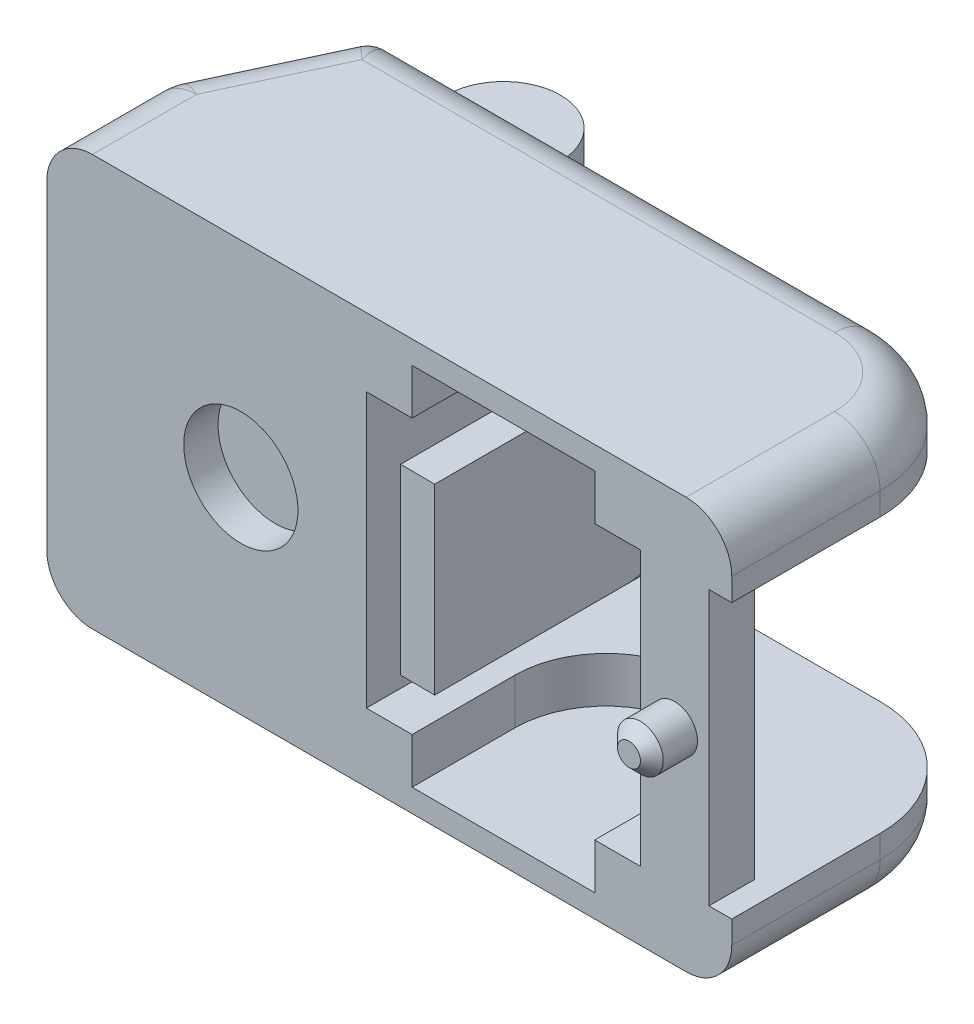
ISO-10303-21;
HEADER;
FILE_DESCRIPTION(('STEP AP214'),'2;1');
FILE_NAME('part.step','',(''),(''),'','','');
FILE_SCHEMA(('AUTOMOTIVE_DESIGN { 1 0 10303 214 1 1 1 1 }'));
ENDSEC;
DATA;
#1=APPLICATION_CONTEXT('core data for automotive mechanical design processes');
#2=APPLICATION_PROTOCOL_DEFINITION('international standard','automotive_design',2000,#1);
#3=PRODUCT_CONTEXT('',#1,'mechanical');
#4=PRODUCT('Part','Part','',(#3));
#5=PRODUCT_RELATED_PRODUCT_CATEGORY('part','',(#4));
#6=PRODUCT_DEFINITION_FORMATION('','',#4);
#7=PRODUCT_DEFINITION_CONTEXT('part definition',#1,'design');
#8=PRODUCT_DEFINITION('design','',#6,#7);
#9=PRODUCT_DEFINITION_SHAPE('','',#8);
#10=(LENGTH_UNIT() NAMED_UNIT(*) SI_UNIT(.MILLI.,.METRE.));
#11=(NAMED_UNIT(*) PLANE_ANGLE_UNIT() SI_UNIT($,.RADIAN.));
#12=(NAMED_UNIT(*) SI_UNIT($,.STERADIAN.) SOLID_ANGLE_UNIT());
#13=UNCERTAINTY_MEASURE_WITH_UNIT(LENGTH_MEASURE(1.E-05),#10,'distance_accuracy_value','');
#14=(GEOMETRIC_REPRESENTATION_CONTEXT(3) GLOBAL_UNCERTAINTY_ASSIGNED_CONTEXT((#13)) GLOBAL_UNIT_ASSIGNED_CONTEXT((#10,
#11,#12)) REPRESENTATION_CONTEXT('',''));
#15=CARTESIAN_POINT('',(0.,0.,0.));
#16=DIRECTION('',(0.,0.,1.));
#17=DIRECTION('',(1.,0.,0.));
#18=AXIS2_PLACEMENT_3D('',#15,#16,#17);
#19=CARTESIAN_POINT('',(21.5,-9.,-1.11022302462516E-13));
#20=DIRECTION('',(0.,0.,-1.));
#21=DIRECTION('',(1.,0.,0.));
#22=AXIS2_PLACEMENT_3D('',#19,#20,#21);
#23=PLANE('',#22);
#24=CARTESIAN_POINT('',(0.,0.,-1.38777878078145E-13));
#25=DIRECTION('',(0.,0.,1.));
#26=DIRECTION('',(-1.,0.,0.));
#27=AXIS2_PLACEMENT_3D('',#24,#25,#26);
#28=CIRCLE('',#27,2.5);
#29=CARTESIAN_POINT('',(-2.5,0.,-1.2472216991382E-13));
#30=VERTEX_POINT('',#29);
#31=EDGE_CURVE('E1498',#30,#30,#28,.T.);
#32=ORIENTED_EDGE('',*,*,#31,.F.);
#33=EDGE_LOOP('',(#32));
#34=FACE_BOUND('',#33,.T.);
#35=CARTESIAN_POINT('',(19.,0.,-1.11022302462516E-13));
#36=DIRECTION('',(0.,0.,-1.));
#37=DIRECTION('',(0.,1.,0.));
#38=AXIS2_PLACEMENT_3D('',#35,#36,#37);
#39=CIRCLE('',#38,1.);
#40=CARTESIAN_POINT('',(19.,1.,-1.11022302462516E-13));
#41=VERTEX_POINT('',#40);
#42=EDGE_CURVE('E1476',#41,#41,#39,.T.);
#43=ORIENTED_EDGE('',*,*,#42,.T.);
#44=EDGE_LOOP('',(#43));
#45=FACE_BOUND('',#44,.T.);
#46=DIRECTION('',(-1.,0.,0.));
#47=VECTOR('',#46,1.);
#48=CARTESIAN_POINT('',(21.5,6.,-1.11022302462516E-13));
#49=LINE('',#48,#47);
#50=CARTESIAN_POINT('',(21.5,6.,-1.11022302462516E-13));
#51=VERTEX_POINT('',#50);
#52=CARTESIAN_POINT('',(20.5,6.,-1.11022302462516E-13));
#53=VERTEX_POINT('',#52);
#54=EDGE_CURVE('E634',#51,#53,#49,.T.);
#55=ORIENTED_EDGE('',*,*,#54,.F.);
#56=DIRECTION('',(0.,1.,0.));
#57=VECTOR('',#56,1.);
#58=CARTESIAN_POINT('',(21.5,-9.,-1.11022302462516E-13));
#59=LINE('',#58,#57);
#60=CARTESIAN_POINT('',(21.5,7.,-1.11022302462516E-13));
#61=VERTEX_POINT('',#60);
#62=EDGE_CURVE('E436',#51,#61,#59,.T.);
#63=ORIENTED_EDGE('',*,*,#62,.T.);
#64=CARTESIAN_POINT('',(19.5,7.,-1.11022302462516E-13));
#65=DIRECTION('',(0.,0.,-1.));
#66=DIRECTION('',(1.,0.,0.));
#67=AXIS2_PLACEMENT_3D('',#64,#65,#66);
#68=CIRCLE('',#67,2.);
#69=CARTESIAN_POINT('',(19.5,9.,-1.11022302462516E-13));
#70=VERTEX_POINT('',#69);
#71=EDGE_CURVE('E493',#61,#70,#68,.F.);
#72=ORIENTED_EDGE('',*,*,#71,.T.);
#73=DIRECTION('',(-1.,0.,0.));
#74=VECTOR('',#73,1.);
#75=CARTESIAN_POINT('',(21.5,9.,-1.11022302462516E-13));
#76=LINE('',#75,#74);
#77=CARTESIAN_POINT('',(-6.5,9.,-1.11022302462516E-13));
#78=VERTEX_POINT('',#77);
#79=EDGE_CURVE('E427',#70,#78,#76,.T.);
#80=ORIENTED_EDGE('',*,*,#79,.T.);
#81=CARTESIAN_POINT('',(-6.5,7.,-1.11022302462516E-13));
#82=DIRECTION('',(0.,0.,-1.));
#83=DIRECTION('',(1.,0.,0.));
#84=AXIS2_PLACEMENT_3D('',#81,#82,#83);
#85=CIRCLE('',#84,2.);
#86=CARTESIAN_POINT('',(-8.5,7.,0.));
#87=VERTEX_POINT('',#86);
#88=EDGE_CURVE('E489',#78,#87,#85,.F.);
#89=ORIENTED_EDGE('',*,*,#88,.T.);
#90=DIRECTION('',(0.,1.,0.));
#91=VECTOR('',#90,1.);
#92=CARTESIAN_POINT('',(-8.5,-9.,0.));
#93=LINE('',#92,#91);
#94=CARTESIAN_POINT('',(-8.5,-7.,0.));
#95=VERTEX_POINT('',#94);
#96=EDGE_CURVE('E433',#95,#87,#93,.T.);
#97=ORIENTED_EDGE('',*,*,#96,.F.);
#98=CARTESIAN_POINT('',(-6.5,-7.,-1.11022302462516E-13));
#99=DIRECTION('',(0.,0.,-1.));
#100=DIRECTION('',(1.,0.,0.));
#101=AXIS2_PLACEMENT_3D('',#98,#99,#100);
#102=CIRCLE('',#101,2.);
#103=CARTESIAN_POINT('',(-6.5,-9.,-1.11022302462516E-13));
#104=VERTEX_POINT('',#103);
#105=EDGE_CURVE('E487',#95,#104,#102,.F.);
#106=ORIENTED_EDGE('',*,*,#105,.T.);
#107=DIRECTION('',(-1.,0.,0.));
#108=VECTOR('',#107,1.);
#109=CARTESIAN_POINT('',(21.5,-9.,-1.11022302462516E-13));
#110=LINE('',#109,#108);
#111=CARTESIAN_POINT('',(19.5,-9.,-1.11022302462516E-13));
#112=VERTEX_POINT('',#111);
#113=EDGE_CURVE('E429',#112,#104,#110,.T.);
#114=ORIENTED_EDGE('',*,*,#113,.F.);
#115=CARTESIAN_POINT('',(19.5,-7.,-1.11022302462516E-13));
#116=DIRECTION('',(0.,0.,-1.));
#117=DIRECTION('',(1.,0.,0.));
#118=AXIS2_PLACEMENT_3D('',#115,#116,#117);
#119=CIRCLE('',#118,2.);
#120=CARTESIAN_POINT('',(21.5,-7.,-1.11022302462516E-13));
#121=VERTEX_POINT('',#120);
#122=EDGE_CURVE('E491',#112,#121,#119,.F.);
#123=ORIENTED_EDGE('',*,*,#122,.T.);
#124=CARTESIAN_POINT('',(21.5,-6.,-1.11022302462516E-13));
#125=VERTEX_POINT('',#124);
#126=EDGE_CURVE('E437',#121,#125,#59,.T.);
#127=ORIENTED_EDGE('',*,*,#126,.T.);
#128=DIRECTION('',(-1.,0.,0.));
#129=VECTOR('',#128,1.);
#130=CARTESIAN_POINT('',(21.5,-6.,-1.11022302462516E-13));
#131=LINE('',#130,#129);
#132=CARTESIAN_POINT('',(20.5,-6.,-1.11022302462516E-13));
#133=VERTEX_POINT('',#132);
#134=EDGE_CURVE('E604',#125,#133,#131,.T.);
#135=ORIENTED_EDGE('',*,*,#134,.T.);
#136=DIRECTION('',(0.,-1.,0.));
#137=VECTOR('',#136,1.);
#138=CARTESIAN_POINT('',(20.5,6.,-1.11022302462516E-13));
#139=LINE('',#138,#137);
#140=EDGE_CURVE('E637',#53,#133,#139,.T.);
#141=ORIENTED_EDGE('',*,*,#140,.F.);
#142=EDGE_LOOP('',(#55,#63,#72,#80,#89,#97,#106,#114,#123,#127,#135,#141));
#143=FACE_BOUND('',#142,.T.);
#144=DIRECTION('',(0.,-1.,0.));
#145=VECTOR('',#144,1.);
#146=CARTESIAN_POINT('',(15.5,8.,0.));
#147=LINE('',#146,#145);
#148=CARTESIAN_POINT('',(15.5,8.,0.));
#149=VERTEX_POINT('',#148);
#150=CARTESIAN_POINT('',(15.5,6.,0.));
#151=VERTEX_POINT('',#150);
#152=EDGE_CURVE('E568',#149,#151,#147,.T.);
#153=ORIENTED_EDGE('',*,*,#152,.T.);
#154=DIRECTION('',(-1.,0.,0.));
#155=VECTOR('',#154,1.);
#156=CARTESIAN_POINT('',(17.5,6.,0.));
#157=LINE('',#156,#155);
#158=CARTESIAN_POINT('',(17.5,6.,0.));
#159=VERTEX_POINT('',#158);
#160=EDGE_CURVE('E622',#159,#151,#157,.T.);
#161=ORIENTED_EDGE('',*,*,#160,.F.);
#162=DIRECTION('',(0.,-1.,0.));
#163=VECTOR('',#162,1.);
#164=CARTESIAN_POINT('',(17.5,6.,0.));
#165=LINE('',#164,#163);
#166=CARTESIAN_POINT('',(17.5,-6.,0.));
#167=VERTEX_POINT('',#166);
#168=EDGE_CURVE('E644',#159,#167,#165,.T.);
#169=ORIENTED_EDGE('',*,*,#168,.T.);
#170=DIRECTION('',(-1.,0.,0.));
#171=VECTOR('',#170,1.);
#172=CARTESIAN_POINT('',(17.5,-6.,0.));
#173=LINE('',#172,#171);
#174=CARTESIAN_POINT('',(15.5,-6.,0.));
#175=VERTEX_POINT('',#174);
#176=EDGE_CURVE('E593',#167,#175,#173,.T.);
#177=ORIENTED_EDGE('',*,*,#176,.T.);
#178=CARTESIAN_POINT('',(15.5,-8.,0.));
#179=VERTEX_POINT('',#178);
#180=EDGE_CURVE('E563',#175,#179,#147,.T.);
#181=ORIENTED_EDGE('',*,*,#180,.T.);
#182=DIRECTION('',(1.,0.,0.));
#183=VECTOR('',#182,1.);
#184=CARTESIAN_POINT('',(7.5,-8.,0.));
#185=LINE('',#184,#183);
#186=CARTESIAN_POINT('',(7.5,-8.,0.));
#187=VERTEX_POINT('',#186);
#188=EDGE_CURVE('E1388',#187,#179,#185,.T.);
#189=ORIENTED_EDGE('',*,*,#188,.F.);
#190=DIRECTION('',(0.,-1.,0.));
#191=VECTOR('',#190,1.);
#192=CARTESIAN_POINT('',(7.5,8.,0.));
#193=LINE('',#192,#191);
#194=CARTESIAN_POINT('',(7.5,-6.,0.));
#195=VERTEX_POINT('',#194);
#196=EDGE_CURVE('E1412',#195,#187,#193,.T.);
#197=ORIENTED_EDGE('',*,*,#196,.F.);
#198=CARTESIAN_POINT('',(5.5,-6.,0.));
#199=VERTEX_POINT('',#198);
#200=EDGE_CURVE('E592',#195,#199,#173,.T.);
#201=ORIENTED_EDGE('',*,*,#200,.T.);
#202=DIRECTION('',(0.,-1.,0.));
#203=VECTOR('',#202,1.);
#204=CARTESIAN_POINT('',(5.5,6.,0.));
#205=LINE('',#204,#203);
#206=CARTESIAN_POINT('',(5.5,6.,0.));
#207=VERTEX_POINT('',#206);
#208=EDGE_CURVE('E647',#207,#199,#205,.T.);
#209=ORIENTED_EDGE('',*,*,#208,.F.);
#210=CARTESIAN_POINT('',(7.5,6.,0.));
#211=VERTEX_POINT('',#210);
#212=EDGE_CURVE('E621',#211,#207,#157,.T.);
#213=ORIENTED_EDGE('',*,*,#212,.F.);
#214=CARTESIAN_POINT('',(7.5,8.,0.));
#215=VERTEX_POINT('',#214);
#216=EDGE_CURVE('E1413',#215,#211,#193,.T.);
#217=ORIENTED_EDGE('',*,*,#216,.F.);
#218=DIRECTION('',(1.,0.,0.));
#219=VECTOR('',#218,1.);
#220=CARTESIAN_POINT('',(7.5,8.,0.));
#221=LINE('',#220,#219);
#222=EDGE_CURVE('E1401',#215,#149,#221,.T.);
#223=ORIENTED_EDGE('',*,*,#222,.T.);
#224=EDGE_LOOP('',(#153,#161,#169,#177,#181,#189,#197,#201,#209,#213,#217,#223));
#225=FACE_BOUND('',#224,.T.);
#226=ADVANCED_FACE('F16',(#34,#45,#143,#225),#23,.F.);
#227=CARTESIAN_POINT('',(21.5,6.,-11.5000000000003));
#228=DIRECTION('',(0.,-1.,0.));
#229=DIRECTION('',(1.,0.,0.));
#230=AXIS2_PLACEMENT_3D('',#227,#228,#229);
#231=PLANE('',#230);
#232=ORIENTED_EDGE('',*,*,#160,.T.);
#233=DIRECTION('',(0.,0.,-1.));
#234=VECTOR('',#233,1.);
#235=CARTESIAN_POINT('',(15.5,6.,-11.5000000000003));
#236=LINE('',#235,#234);
#237=CARTESIAN_POINT('',(15.5,6.,-4.50000000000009));
#238=VERTEX_POINT('',#237);
#239=EDGE_CURVE('E575',#151,#238,#236,.T.);
#240=ORIENTED_EDGE('',*,*,#239,.T.);
#241=CARTESIAN_POINT('',(11.5,6.,-4.5));
#242=DIRECTION('',(0.,-1.,0.));
#243=DIRECTION('',(1.,0.,0.));
#244=AXIS2_PLACEMENT_3D('',#241,#242,#243);
#245=CIRCLE('',#244,4.);
#246=CARTESIAN_POINT('',(7.5,6.,-4.5));
#247=VERTEX_POINT('',#246);
#248=EDGE_CURVE('E573',#247,#238,#245,.T.);
#249=ORIENTED_EDGE('',*,*,#248,.F.);
#250=DIRECTION('',(0.,0.,-1.));
#251=VECTOR('',#250,1.);
#252=CARTESIAN_POINT('',(7.4999999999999,6.,-11.5000000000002));
#253=LINE('',#252,#251);
#254=EDGE_CURVE('E571',#211,#247,#253,.T.);
#255=ORIENTED_EDGE('',*,*,#254,.F.);
#256=ORIENTED_EDGE('',*,*,#212,.T.);
#257=DIRECTION('',(0.,0.,1.));
#258=VECTOR('',#257,1.);
#259=CARTESIAN_POINT('',(5.49999999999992,6.,-9.00000000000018));
#260=LINE('',#259,#258);
#261=CARTESIAN_POINT('',(5.49999999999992,6.,-9.00000000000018));
#262=VERTEX_POINT('',#261);
#263=EDGE_CURVE('E618',#262,#207,#260,.T.);
#264=ORIENTED_EDGE('',*,*,#263,.F.);
#265=DIRECTION('',(1.,0.,0.));
#266=VECTOR('',#265,1.);
#267=CARTESIAN_POINT('',(5.49999999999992,6.,-9.00000000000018));
#268=LINE('',#267,#266);
#269=CARTESIAN_POINT('',(6.4999999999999,6.,-9.00000000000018));
#270=VERTEX_POINT('',#269);
#271=EDGE_CURVE('E615',#262,#270,#268,.T.);
#272=ORIENTED_EDGE('',*,*,#271,.T.);
#273=DIRECTION('',(0.,0.,1.));
#274=VECTOR('',#273,1.);
#275=CARTESIAN_POINT('',(6.4999999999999,6.,-11.5000000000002));
#276=LINE('',#275,#274);
#277=CARTESIAN_POINT('',(6.4999999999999,6.,-11.5000000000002));
#278=VERTEX_POINT('',#277);
#279=EDGE_CURVE('E612',#278,#270,#276,.T.);
#280=ORIENTED_EDGE('',*,*,#279,.F.);
#281=DIRECTION('',(1.,0.,0.));
#282=VECTOR('',#281,1.);
#283=CARTESIAN_POINT('',(6.4999999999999,6.,-11.5000000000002));
#284=LINE('',#283,#282);
#285=CARTESIAN_POINT('',(16.5,6.,-11.5000000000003));
#286=VERTEX_POINT('',#285);
#287=EDGE_CURVE('E610',#278,#286,#284,.T.);
#288=ORIENTED_EDGE('',*,*,#287,.T.);
#289=CARTESIAN_POINT('',(16.5,6.,-6.50000000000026));
#290=DIRECTION('',(0.,-1.,0.));
#291=DIRECTION('',(1.,0.,0.));
#292=AXIS2_PLACEMENT_3D('',#289,#290,#291);
#293=CIRCLE('',#292,5.);
#294=CARTESIAN_POINT('',(21.5,6.,-6.50000000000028));
#295=VERTEX_POINT('',#294);
#296=EDGE_CURVE('E662',#286,#295,#293,.T.);
#297=ORIENTED_EDGE('',*,*,#296,.T.);
#298=DIRECTION('',(0.,0.,-1.));
#299=VECTOR('',#298,1.);
#300=CARTESIAN_POINT('',(21.5,6.,-1.11022302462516E-13));
#301=LINE('',#300,#299);
#302=EDGE_CURVE('E607',#51,#295,#301,.T.);
#303=ORIENTED_EDGE('',*,*,#302,.F.);
#304=ORIENTED_EDGE('',*,*,#54,.T.);
#305=DIRECTION('',(0.,0.,-1.));
#306=VECTOR('',#305,1.);
#307=CARTESIAN_POINT('',(20.5,6.,-1.11022302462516E-13));
#308=LINE('',#307,#306);
#309=CARTESIAN_POINT('',(20.5,6.,-2.00000000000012));
#310=VERTEX_POINT('',#309);
#311=EDGE_CURVE('E631',#53,#310,#308,.T.);
#312=ORIENTED_EDGE('',*,*,#311,.T.);
#313=DIRECTION('',(1.,0.,0.));
#314=VECTOR('',#313,1.);
#315=CARTESIAN_POINT('',(17.5,6.,-2.00000000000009));
#316=LINE('',#315,#314);
#317=CARTESIAN_POINT('',(17.5,6.,-2.00000000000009));
#318=VERTEX_POINT('',#317);
#319=EDGE_CURVE('E628',#318,#310,#316,.T.);
#320=ORIENTED_EDGE('',*,*,#319,.F.);
#321=DIRECTION('',(0.,0.,1.));
#322=VECTOR('',#321,1.);
#323=CARTESIAN_POINT('',(17.5,6.,-2.00000000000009));
#324=LINE('',#323,#322);
#325=EDGE_CURVE('E625',#318,#159,#324,.T.);
#326=ORIENTED_EDGE('',*,*,#325,.T.);
#327=EDGE_LOOP('',(#232,#240,#249,#255,#256,#264,#272,#280,#288,#297,#303,#304,#312,#320,#326));
#328=FACE_BOUND('',#327,.T.);
#329=ADVANCED_FACE('F719',(#328),#231,.T.);
#330=CARTESIAN_POINT('',(21.5,-6.,-11.5000000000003));
#331=DIRECTION('',(0.,-1.,0.));
#332=DIRECTION('',(1.,0.,0.));
#333=AXIS2_PLACEMENT_3D('',#330,#331,#332);
#334=PLANE('',#333);
#335=DIRECTION('',(0.,0.,-1.));
#336=VECTOR('',#335,1.);
#337=CARTESIAN_POINT('',(15.5,-6.,-11.5000000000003));
#338=LINE('',#337,#336);
#339=CARTESIAN_POINT('',(15.5,-6.,-4.50000000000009));
#340=VERTEX_POINT('',#339);
#341=EDGE_CURVE('E10',#175,#340,#338,.T.);
#342=ORIENTED_EDGE('',*,*,#341,.F.);
#343=ORIENTED_EDGE('',*,*,#176,.F.);
#344=DIRECTION('',(0.,0.,1.));
#345=VECTOR('',#344,1.);
#346=CARTESIAN_POINT('',(17.5,-6.,-2.00000000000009));
#347=LINE('',#346,#345);
#348=CARTESIAN_POINT('',(17.5,-6.,-2.00000000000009));
#349=VERTEX_POINT('',#348);
#350=EDGE_CURVE('E595',#349,#167,#347,.T.);
#351=ORIENTED_EDGE('',*,*,#350,.F.);
#352=DIRECTION('',(1.,0.,0.));
#353=VECTOR('',#352,1.);
#354=CARTESIAN_POINT('',(17.5,-6.,-2.00000000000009));
#355=LINE('',#354,#353);
#356=CARTESIAN_POINT('',(20.5,-6.,-2.00000000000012));
#357=VERTEX_POINT('',#356);
#358=EDGE_CURVE('E598',#349,#357,#355,.T.);
#359=ORIENTED_EDGE('',*,*,#358,.T.);
#360=DIRECTION('',(0.,0.,-1.));
#361=VECTOR('',#360,1.);
#362=CARTESIAN_POINT('',(20.5,-6.,-1.11022302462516E-13));
#363=LINE('',#362,#361);
#364=EDGE_CURVE('E601',#133,#357,#363,.T.);
#365=ORIENTED_EDGE('',*,*,#364,.F.);
#366=ORIENTED_EDGE('',*,*,#134,.F.);
#367=DIRECTION('',(0.,0.,-1.));
#368=VECTOR('',#367,1.);
#369=CARTESIAN_POINT('',(21.5,-6.,-1.11022302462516E-13));
#370=LINE('',#369,#368);
#371=CARTESIAN_POINT('',(21.5,-6.,-6.50000000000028));
#372=VERTEX_POINT('',#371);
#373=EDGE_CURVE('E578',#125,#372,#370,.T.);
#374=ORIENTED_EDGE('',*,*,#373,.T.);
#375=CARTESIAN_POINT('',(16.5,-6.,-6.50000000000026));
#376=DIRECTION('',(0.,-1.,0.));
#377=DIRECTION('',(1.,0.,0.));
#378=AXIS2_PLACEMENT_3D('',#375,#376,#377);
#379=CIRCLE('',#378,5.);
#380=CARTESIAN_POINT('',(16.5,-6.,-11.5000000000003));
#381=VERTEX_POINT('',#380);
#382=EDGE_CURVE('E659',#381,#372,#379,.T.);
#383=ORIENTED_EDGE('',*,*,#382,.F.);
#384=DIRECTION('',(1.,0.,0.));
#385=VECTOR('',#384,1.);
#386=CARTESIAN_POINT('',(6.4999999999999,-6.,-11.5000000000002));
#387=LINE('',#386,#385);
#388=CARTESIAN_POINT('',(6.4999999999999,-6.,-11.5000000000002));
#389=VERTEX_POINT('',#388);
#390=EDGE_CURVE('E580',#389,#381,#387,.T.);
#391=ORIENTED_EDGE('',*,*,#390,.F.);
#392=DIRECTION('',(0.,0.,1.));
#393=VECTOR('',#392,1.);
#394=CARTESIAN_POINT('',(6.4999999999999,-6.,-11.5000000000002));
#395=LINE('',#394,#393);
#396=CARTESIAN_POINT('',(6.4999999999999,-6.,-9.00000000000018));
#397=VERTEX_POINT('',#396);
#398=EDGE_CURVE('E583',#389,#397,#395,.T.);
#399=ORIENTED_EDGE('',*,*,#398,.T.);
#400=DIRECTION('',(1.,0.,0.));
#401=VECTOR('',#400,1.);
#402=CARTESIAN_POINT('',(5.49999999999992,-6.,-9.00000000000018));
#403=LINE('',#402,#401);
#404=CARTESIAN_POINT('',(5.49999999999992,-6.,-9.00000000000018));
#405=VERTEX_POINT('',#404);
#406=EDGE_CURVE('E586',#405,#397,#403,.T.);
#407=ORIENTED_EDGE('',*,*,#406,.F.);
#408=DIRECTION('',(0.,0.,1.));
#409=VECTOR('',#408,1.);
#410=CARTESIAN_POINT('',(5.49999999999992,-6.,-9.00000000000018));
#411=LINE('',#410,#409);
#412=EDGE_CURVE('E589',#405,#199,#411,.T.);
#413=ORIENTED_EDGE('',*,*,#412,.T.);
#414=ORIENTED_EDGE('',*,*,#200,.F.);
#415=DIRECTION('',(0.,0.,-1.));
#416=VECTOR('',#415,1.);
#417=CARTESIAN_POINT('',(7.4999999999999,-6.,-11.5000000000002));
#418=LINE('',#417,#416);
#419=CARTESIAN_POINT('',(7.5,-6.,-4.5));
#420=VERTEX_POINT('',#419);
#421=EDGE_CURVE('E539',#195,#420,#418,.T.);
#422=ORIENTED_EDGE('',*,*,#421,.T.);
#423=CARTESIAN_POINT('',(11.5,-6.,-4.5));
#424=DIRECTION('',(0.,-1.,0.));
#425=DIRECTION('',(1.,0.,0.));
#426=AXIS2_PLACEMENT_3D('',#423,#424,#425);
#427=CIRCLE('',#426,4.);
#428=EDGE_CURVE('E24',#420,#340,#427,.T.);
#429=ORIENTED_EDGE('',*,*,#428,.T.);
#430=EDGE_LOOP('',(#342,#343,#351,#359,#365,#366,#374,#383,#391,#399,#407,#413,#414,#422,#429));
#431=FACE_BOUND('',#430,.T.);
#432=ADVANCED_FACE('F545',(#431),#334,.F.);
#433=CARTESIAN_POINT('',(16.5,-9.,-11.5000000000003));
#434=DIRECTION('',(0.,0.,-1.));
#435=DIRECTION('',(1.,0.,0.));
#436=AXIS2_PLACEMENT_3D('',#433,#434,#435);
#437=PLANE('',#436);
#438=CARTESIAN_POINT('',(0.,0.,-11.5));
#439=DIRECTION('',(0.,0.,-1.));
#440=DIRECTION('',(1.,0.,0.));
#441=AXIS2_PLACEMENT_3D('',#438,#439,#440);
#442=CIRCLE('',#441,3.5);
#443=CARTESIAN_POINT('',(2.50000000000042,2.44948974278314,-11.5));
#444=VERTEX_POINT('',#443);
#445=CARTESIAN_POINT('',(2.49999999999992,-2.44948974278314,-11.5000000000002));
#446=VERTEX_POINT('',#445);
#447=EDGE_CURVE('E31',#444,#446,#442,.T.);
#448=ORIENTED_EDGE('',*,*,#447,.F.);
#449=DIRECTION('',(0.,1.,0.));
#450=VECTOR('',#449,1.);
#451=CARTESIAN_POINT('',(2.49999999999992,-7.5,-11.5000000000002));
#452=LINE('',#451,#450);
#453=CARTESIAN_POINT('',(2.49999999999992,7.,-11.5000000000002));
#454=VERTEX_POINT('',#453);
#455=EDGE_CURVE('E332',#444,#454,#452,.T.);
#456=ORIENTED_EDGE('',*,*,#455,.T.);
#457=DIRECTION('',(-1.,0.,0.));
#458=VECTOR('',#457,1.);
#459=CARTESIAN_POINT('',(-4.83192996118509,7.,-11.5));
#460=LINE('',#459,#458);
#461=CARTESIAN_POINT('',(16.5,7.,-11.5000000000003));
#462=VERTEX_POINT('',#461);
#463=EDGE_CURVE('E475',#454,#462,#460,.F.);
#464=ORIENTED_EDGE('',*,*,#463,.T.);
#465=DIRECTION('',(0.,1.,0.));
#466=VECTOR('',#465,1.);
#467=CARTESIAN_POINT('',(16.5,-9.,-11.5000000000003));
#468=LINE('',#467,#466);
#469=EDGE_CURVE('E444',#286,#462,#468,.T.);
#470=ORIENTED_EDGE('',*,*,#469,.F.);
#471=ORIENTED_EDGE('',*,*,#287,.F.);
#472=DIRECTION('',(0.,-1.,0.));
#473=VECTOR('',#472,1.);
#474=CARTESIAN_POINT('',(6.4999999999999,6.,-11.5000000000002));
#475=LINE('',#474,#473);
#476=EDGE_CURVE('E656',#278,#389,#475,.T.);
#477=ORIENTED_EDGE('',*,*,#476,.T.);
#478=ORIENTED_EDGE('',*,*,#390,.T.);
#479=CARTESIAN_POINT('',(16.5,-7.,-11.5000000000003));
#480=VERTEX_POINT('',#479);
#481=EDGE_CURVE('E445',#480,#381,#468,.T.);
#482=ORIENTED_EDGE('',*,*,#481,.F.);
#483=DIRECTION('',(-1.,0.,0.));
#484=VECTOR('',#483,1.);
#485=CARTESIAN_POINT('',(16.5,-7.,-11.5000000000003));
#486=LINE('',#485,#484);
#487=CARTESIAN_POINT('',(2.49999999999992,-7.,-11.5000000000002));
#488=VERTEX_POINT('',#487);
#489=EDGE_CURVE('E480',#480,#488,#486,.T.);
#490=ORIENTED_EDGE('',*,*,#489,.T.);
#491=EDGE_CURVE('E335',#488,#446,#452,.T.);
#492=ORIENTED_EDGE('',*,*,#491,.T.);
#493=EDGE_LOOP('',(#448,#456,#464,#470,#471,#477,#478,#482,#490,#492));
#494=FACE_BOUND('',#493,.T.);
#495=ADVANCED_FACE('F330',(#494),#437,.T.);
#496=CARTESIAN_POINT('',(16.5,-9.,-6.50000000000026));
#497=DIRECTION('',(0.,1.,0.));
#498=DIRECTION('',(-1.,0.,0.));
#499=AXIS2_PLACEMENT_3D('',#496,#497,#498);
#500=CYLINDRICAL_SURFACE('',#499,5.);
#501=ORIENTED_EDGE('',*,*,#296,.F.);
#502=ORIENTED_EDGE('',*,*,#469,.T.);
#503=CARTESIAN_POINT('',(16.5,7.,-6.50000000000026));
#504=DIRECTION('',(0.,-1.,0.));
#505=DIRECTION('',(1.,0.,0.));
#506=AXIS2_PLACEMENT_3D('',#503,#504,#505);
#507=CIRCLE('',#506,5.);
#508=CARTESIAN_POINT('',(21.5,7.,-6.50000000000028));
#509=VERTEX_POINT('',#508);
#510=EDGE_CURVE('E506',#462,#509,#507,.T.);
#511=ORIENTED_EDGE('',*,*,#510,.T.);
#512=DIRECTION('',(0.,1.,0.));
#513=VECTOR('',#512,1.);
#514=CARTESIAN_POINT('',(21.5,-9.,-6.50000000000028));
#515=LINE('',#514,#513);
#516=EDGE_CURVE('E440',#295,#509,#515,.T.);
#517=ORIENTED_EDGE('',*,*,#516,.F.);
#518=EDGE_LOOP('',(#501,#502,#511,#517));
#519=FACE_BOUND('',#518,.T.);
#520=ADVANCED_FACE('F744',(#519),#500,.T.);
#521=CARTESIAN_POINT('',(21.5,-9.,-6.50000000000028));
#522=DIRECTION('',(-1.,0.,0.));
#523=DIRECTION('',(0.,0.,-1.));
#524=AXIS2_PLACEMENT_3D('',#521,#522,#523);
#525=PLANE('',#524);
#526=ORIENTED_EDGE('',*,*,#302,.T.);
#527=ORIENTED_EDGE('',*,*,#516,.T.);
#528=DIRECTION('',(0.,0.,1.));
#529=VECTOR('',#528,1.);
#530=CARTESIAN_POINT('',(21.5,7.,-6.50000000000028));
#531=LINE('',#530,#529);
#532=EDGE_CURVE('E484',#509,#61,#531,.T.);
#533=ORIENTED_EDGE('',*,*,#532,.T.);
#534=ORIENTED_EDGE('',*,*,#62,.F.);
#535=EDGE_LOOP('',(#526,#527,#533,#534));
#536=FACE_BOUND('',#535,.T.);
#537=ADVANCED_FACE('F739',(#536),#525,.F.);
#538=CARTESIAN_POINT('',(-8.5,-9.,-4.99999999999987));
#539=DIRECTION('',(0.906307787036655,0.,0.422618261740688));
#540=DIRECTION('',(-0.422618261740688,0.,0.906307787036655));
#541=AXIS2_PLACEMENT_3D('',#538,#539,#540);
#542=PLANE('',#541);
#543=DIRECTION('',(0.422618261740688,0.,-0.906307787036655));
#544=VECTOR('',#543,1.);
#545=CARTESIAN_POINT('',(-5.73823774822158,-7.,-10.9226182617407));
#546=LINE('',#545,#544);
#547=CARTESIAN_POINT('',(-5.73823774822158,-7.,-10.9226182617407));
#548=VERTEX_POINT('',#547);
#549=CARTESIAN_POINT('',(-8.31261557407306,-7.,-5.40184719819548));
#550=VERTEX_POINT('',#549);
#551=EDGE_CURVE('E468',#548,#550,#546,.F.);
#552=ORIENTED_EDGE('',*,*,#551,.T.);
#553=DIRECTION('',(0.,1.,0.));
#554=VECTOR('',#553,1.);
#555=CARTESIAN_POINT('',(-8.31261557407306,-9.,-5.40184719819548));
#556=LINE('',#555,#554);
#557=CARTESIAN_POINT('',(-8.31261557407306,7.,-5.40184719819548));
#558=VERTEX_POINT('',#557);
#559=EDGE_CURVE('E521',#550,#558,#556,.T.);
#560=ORIENTED_EDGE('',*,*,#559,.T.);
#561=DIRECTION('',(0.422618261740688,0.,-0.906307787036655));
#562=VECTOR('',#561,1.);
#563=CARTESIAN_POINT('',(-8.5,7.,-4.99999999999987));
#564=LINE('',#563,#562);
#565=CARTESIAN_POINT('',(-5.73823774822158,7.,-10.9226182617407));
#566=VERTEX_POINT('',#565);
#567=EDGE_CURVE('E466',#558,#566,#564,.T.);
#568=ORIENTED_EDGE('',*,*,#567,.T.);
#569=DIRECTION('',(0.,1.,0.));
#570=VECTOR('',#569,1.);
#571=CARTESIAN_POINT('',(-5.73823774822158,-9.,-10.9226182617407));
#572=LINE('',#571,#570);
#573=EDGE_CURVE('E451',#548,#566,#572,.T.);
#574=ORIENTED_EDGE('',*,*,#573,.F.);
#575=EDGE_LOOP('',(#552,#560,#568,#574));
#576=FACE_BOUND('',#575,.T.);
#577=ADVANCED_FACE('F751',(#576),#542,.F.);
#578=CARTESIAN_POINT('',(-4.83192996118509,-9.,-10.5));
#579=DIRECTION('',(0.,1.,0.));
#580=DIRECTION('',(-1.,0.,0.));
#581=AXIS2_PLACEMENT_3D('',#578,#579,#580);
#582=CYLINDRICAL_SURFACE('',#581,1.);
#583=DIRECTION('',(0.,1.,0.));
#584=VECTOR('',#583,1.);
#585=CARTESIAN_POINT('',(-4.83192996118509,-9.,-11.5));
#586=LINE('',#585,#584);
#587=CARTESIAN_POINT('',(-4.83192996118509,-7.,-11.5));
#588=VERTEX_POINT('',#587);
#589=CARTESIAN_POINT('',(-4.83192996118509,7.,-11.5));
#590=VERTEX_POINT('',#589);
#591=EDGE_CURVE('E448',#588,#590,#586,.T.);
#592=ORIENTED_EDGE('',*,*,#591,.F.);
#593=CARTESIAN_POINT('',(-4.83192996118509,-7.,-10.5));
#594=DIRECTION('',(0.,1.,0.));
#595=DIRECTION('',(-1.,0.,0.));
#596=AXIS2_PLACEMENT_3D('',#593,#594,#595);
#597=CIRCLE('',#596,1.);
#598=EDGE_CURVE('E473',#588,#548,#597,.T.);
#599=ORIENTED_EDGE('',*,*,#598,.T.);
#600=ORIENTED_EDGE('',*,*,#573,.T.);
#601=CARTESIAN_POINT('',(-4.83192996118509,7.,-10.5));
#602=DIRECTION('',(0.,-1.,0.));
#603=DIRECTION('',(0.,0.,-1.));
#604=AXIS2_PLACEMENT_3D('',#601,#602,#603);
#605=CIRCLE('',#604,1.);
#606=EDGE_CURVE('E471',#566,#590,#605,.T.);
#607=ORIENTED_EDGE('',*,*,#606,.T.);
#608=EDGE_LOOP('',(#592,#599,#600,#607));
#609=FACE_BOUND('',#608,.T.);
#610=ADVANCED_FACE('F18',(#609),#582,.T.);
#611=CARTESIAN_POINT('',(0.,0.,-11.5));
#612=DIRECTION('',(0.,0.,-1.));
#613=DIRECTION('',(1.,0.,0.));
#614=AXIS2_PLACEMENT_3D('',#611,#612,#613);
#615=CIRCLE('',#614,3.5);
#616=CARTESIAN_POINT('',(-2.50000000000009,-2.44948974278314,-11.5));
#617=VERTEX_POINT('',#616);
#618=CARTESIAN_POINT('',(-2.50000000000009,2.44948974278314,-11.5000000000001));
#619=VERTEX_POINT('',#618);
#620=EDGE_CURVE('E39',#617,#619,#615,.T.);
#621=ORIENTED_EDGE('',*,*,#620,.F.);
#622=DIRECTION('',(0.,1.,0.));
#623=VECTOR('',#622,1.);
#624=CARTESIAN_POINT('',(-2.50000000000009,-7.5,-11.5000000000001));
#625=LINE('',#624,#623);
#626=CARTESIAN_POINT('',(-2.50000000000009,-7.,-11.5000000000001));
#627=VERTEX_POINT('',#626);
#628=EDGE_CURVE('E678',#627,#617,#625,.T.);
#629=ORIENTED_EDGE('',*,*,#628,.F.);
#630=EDGE_CURVE('E479',#627,#588,#486,.T.);
#631=ORIENTED_EDGE('',*,*,#630,.T.);
#632=ORIENTED_EDGE('',*,*,#591,.T.);
#633=CARTESIAN_POINT('',(-2.50000000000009,7.,-11.5000000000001));
#634=VERTEX_POINT('',#633);
#635=EDGE_CURVE('E476',#590,#634,#460,.F.);
#636=ORIENTED_EDGE('',*,*,#635,.T.);
#637=EDGE_CURVE('E679',#619,#634,#625,.T.);
#638=ORIENTED_EDGE('',*,*,#637,.F.);
#639=EDGE_LOOP('',(#621,#629,#631,#632,#636,#638));
#640=FACE_BOUND('',#639,.T.);
#641=ADVANCED_FACE('F742',(#640),#437,.T.);
#642=ORIENTED_EDGE('',*,*,#481,.T.);
#643=ORIENTED_EDGE('',*,*,#382,.T.);
#644=CARTESIAN_POINT('',(21.5,-7.,-6.50000000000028));
#645=VERTEX_POINT('',#644);
#646=EDGE_CURVE('E441',#645,#372,#515,.T.);
#647=ORIENTED_EDGE('',*,*,#646,.F.);
#648=CARTESIAN_POINT('',(16.5,-7.,-6.50000000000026));
#649=DIRECTION('',(0.,-1.,0.));
#650=DIRECTION('',(1.,0.,0.));
#651=AXIS2_PLACEMENT_3D('',#648,#649,#650);
#652=CIRCLE('',#651,5.);
#653=EDGE_CURVE('E509',#645,#480,#652,.F.);
#654=ORIENTED_EDGE('',*,*,#653,.T.);
#655=EDGE_LOOP('',(#642,#643,#647,#654));
#656=FACE_BOUND('',#655,.T.);
#657=ADVANCED_FACE('F737',(#656),#500,.T.);
#658=ORIENTED_EDGE('',*,*,#646,.T.);
#659=ORIENTED_EDGE('',*,*,#373,.F.);
#660=ORIENTED_EDGE('',*,*,#126,.F.);
#661=DIRECTION('',(0.,0.,1.));
#662=VECTOR('',#661,1.);
#663=CARTESIAN_POINT('',(21.5,-7.,-10.5));
#664=LINE('',#663,#662);
#665=EDGE_CURVE('E482',#121,#645,#664,.F.);
#666=ORIENTED_EDGE('',*,*,#665,.T.);
#667=EDGE_LOOP('',(#658,#659,#660,#666));
#668=FACE_BOUND('',#667,.T.);
#669=ADVANCED_FACE('F734',(#668),#525,.F.);
#670=CARTESIAN_POINT('',(-8.5,-9.,-4.99999999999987));
#671=DIRECTION('',(-1.,0.,0.));
#672=DIRECTION('',(0.,-1.,0.));
#673=AXIS2_PLACEMENT_3D('',#670,#671,#672);
#674=PLANE('',#673);
#675=DIRECTION('',(0.,0.,1.));
#676=VECTOR('',#675,1.);
#677=CARTESIAN_POINT('',(-8.5,7.,-10.4999999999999));
#678=LINE('',#677,#676);
#679=CARTESIAN_POINT('',(-8.5,7.,-4.55661067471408));
#680=VERTEX_POINT('',#679);
#681=EDGE_CURVE('E513',#87,#680,#678,.F.);
#682=ORIENTED_EDGE('',*,*,#681,.T.);
#683=DIRECTION('',(0.,1.,0.));
#684=VECTOR('',#683,1.);
#685=CARTESIAN_POINT('',(-8.5,-9.,-4.55661067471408));
#686=LINE('',#685,#684);
#687=CARTESIAN_POINT('',(-8.5,-7.,-4.55661067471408));
#688=VERTEX_POINT('',#687);
#689=EDGE_CURVE('E523',#680,#688,#686,.F.);
#690=ORIENTED_EDGE('',*,*,#689,.T.);
#691=DIRECTION('',(0.,0.,1.));
#692=VECTOR('',#691,1.);
#693=CARTESIAN_POINT('',(-8.5,-7.,-4.99999999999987));
#694=LINE('',#693,#692);
#695=EDGE_CURVE('E511',#688,#95,#694,.T.);
#696=ORIENTED_EDGE('',*,*,#695,.T.);
#697=ORIENTED_EDGE('',*,*,#96,.T.);
#698=EDGE_LOOP('',(#682,#690,#696,#697));
#699=FACE_BOUND('',#698,.T.);
#700=ADVANCED_FACE('F732',(#699),#674,.T.);
#701=CARTESIAN_POINT('',(-4.83192996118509,-9.,-10.5));
#702=DIRECTION('',(0.,-1.,0.));
#703=DIRECTION('',(1.,0.,0.));
#704=AXIS2_PLACEMENT_3D('',#701,#702,#703);
#705=PLANE('',#704);
#706=CARTESIAN_POINT('',(16.5,-9.,-6.50000000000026));
#707=DIRECTION('',(0.,-1.,0.));
#708=DIRECTION('',(1.,0.,0.));
#709=AXIS2_PLACEMENT_3D('',#706,#707,#708);
#710=CIRCLE('',#709,3.);
#711=CARTESIAN_POINT('',(16.5,-9.,-9.50000000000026));
#712=VERTEX_POINT('',#711);
#713=CARTESIAN_POINT('',(19.5,-9.,-6.50000000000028));
#714=VERTEX_POINT('',#713);
#715=EDGE_CURVE('E462',#712,#714,#710,.T.);
#716=ORIENTED_EDGE('',*,*,#715,.T.);
#717=DIRECTION('',(0.,0.,1.));
#718=VECTOR('',#717,1.);
#719=CARTESIAN_POINT('',(19.5,-9.,-10.5));
#720=LINE('',#719,#718);
#721=EDGE_CURVE('E464',#714,#112,#720,.T.);
#722=ORIENTED_EDGE('',*,*,#721,.T.);
#723=ORIENTED_EDGE('',*,*,#113,.T.);
#724=DIRECTION('',(0.,0.,1.));
#725=VECTOR('',#724,1.);
#726=CARTESIAN_POINT('',(-6.50000000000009,-9.,-10.5));
#727=LINE('',#726,#725);
#728=CARTESIAN_POINT('',(-6.5,-9.,-4.55661067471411));
#729=VERTEX_POINT('',#728);
#730=EDGE_CURVE('E454',#104,#729,#727,.F.);
#731=ORIENTED_EDGE('',*,*,#730,.T.);
#732=DIRECTION('',(0.422618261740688,0.,-0.906307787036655));
#733=VECTOR('',#732,1.);
#734=CARTESIAN_POINT('',(-3.92562217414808,-9.,-10.0773817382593));
#735=LINE('',#734,#733);
#736=CARTESIAN_POINT('',(-4.19485970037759,-9.,-9.4999999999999));
#737=VERTEX_POINT('',#736);
#738=EDGE_CURVE('E457',#729,#737,#735,.T.);
#739=ORIENTED_EDGE('',*,*,#738,.T.);
#740=DIRECTION('',(-1.,0.,0.));
#741=VECTOR('',#740,1.);
#742=CARTESIAN_POINT('',(-4.83192996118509,-9.,-9.4999999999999));
#743=LINE('',#742,#741);
#744=EDGE_CURVE('E460',#737,#712,#743,.F.);
#745=ORIENTED_EDGE('',*,*,#744,.T.);
#746=EDGE_LOOP('',(#716,#722,#723,#731,#739,#745));
#747=FACE_BOUND('',#746,.T.);
#748=ADVANCED_FACE('F740',(#747),#705,.T.);
#749=CARTESIAN_POINT('',(-4.83192996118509,9.,-10.5));
#750=DIRECTION('',(0.,-1.,0.));
#751=DIRECTION('',(1.,0.,0.));
#752=AXIS2_PLACEMENT_3D('',#749,#750,#751);
#753=PLANE('',#752);
#754=ORIENTED_EDGE('',*,*,#79,.F.);
#755=DIRECTION('',(0.,0.,1.));
#756=VECTOR('',#755,1.);
#757=CARTESIAN_POINT('',(19.5,9.,-10.5));
#758=LINE('',#757,#756);
#759=CARTESIAN_POINT('',(19.5,9.,-6.50000000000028));
#760=VERTEX_POINT('',#759);
#761=EDGE_CURVE('E504',#70,#760,#758,.F.);
#762=ORIENTED_EDGE('',*,*,#761,.T.);
#763=CARTESIAN_POINT('',(16.5,9.,-6.50000000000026));
#764=DIRECTION('',(0.,-1.,0.));
#765=DIRECTION('',(1.,0.,0.));
#766=AXIS2_PLACEMENT_3D('',#763,#764,#765);
#767=CIRCLE('',#766,3.);
#768=CARTESIAN_POINT('',(16.5,9.,-9.50000000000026));
#769=VERTEX_POINT('',#768);
#770=EDGE_CURVE('E502',#760,#769,#767,.F.);
#771=ORIENTED_EDGE('',*,*,#770,.T.);
#772=DIRECTION('',(-1.,0.,0.));
#773=VECTOR('',#772,1.);
#774=CARTESIAN_POINT('',(-4.83192996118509,9.,-9.4999999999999));
#775=LINE('',#774,#773);
#776=CARTESIAN_POINT('',(-4.19485970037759,9.,-9.4999999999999));
#777=VERTEX_POINT('',#776);
#778=EDGE_CURVE('E500',#769,#777,#775,.T.);
#779=ORIENTED_EDGE('',*,*,#778,.T.);
#780=DIRECTION('',(0.422618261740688,0.,-0.906307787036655));
#781=VECTOR('',#780,1.);
#782=CARTESIAN_POINT('',(-3.92562217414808,9.,-10.0773817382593));
#783=LINE('',#782,#781);
#784=CARTESIAN_POINT('',(-6.5,9.,-4.55661067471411));
#785=VERTEX_POINT('',#784);
#786=EDGE_CURVE('E497',#777,#785,#783,.F.);
#787=ORIENTED_EDGE('',*,*,#786,.T.);
#788=DIRECTION('',(0.,0.,1.));
#789=VECTOR('',#788,1.);
#790=CARTESIAN_POINT('',(-6.50000000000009,9.,-10.5));
#791=LINE('',#790,#789);
#792=EDGE_CURVE('E495',#785,#78,#791,.T.);
#793=ORIENTED_EDGE('',*,*,#792,.T.);
#794=EDGE_LOOP('',(#754,#762,#771,#779,#787,#793));
#795=FACE_BOUND('',#794,.T.);
#796=ADVANCED_FACE('F1137',(#795),#753,.F.);
#797=CARTESIAN_POINT('',(19.5,-7.,-10.5));
#798=DIRECTION('',(0.,0.,-1.));
#799=DIRECTION('',(1.,0.,0.));
#800=AXIS2_PLACEMENT_3D('',#797,#798,#799);
#801=CYLINDRICAL_SURFACE('',#800,2.);
#802=ORIENTED_EDGE('',*,*,#122,.F.);
#803=ORIENTED_EDGE('',*,*,#721,.F.);
#804=CARTESIAN_POINT('',(19.5,-7.,-6.50000000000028));
#805=DIRECTION('',(0.,0.,-1.));
#806=DIRECTION('',(0.,1.,0.));
#807=AXIS2_PLACEMENT_3D('',#804,#805,#806);
#808=CIRCLE('',#807,2.);
#809=EDGE_CURVE('E424',#645,#714,#808,.T.);
#810=ORIENTED_EDGE('',*,*,#809,.F.);
#811=ORIENTED_EDGE('',*,*,#665,.F.);
#812=EDGE_LOOP('',(#802,#803,#810,#811));
#813=FACE_BOUND('',#812,.T.);
#814=ADVANCED_FACE('F1127',(#813),#801,.T.);
#815=CARTESIAN_POINT('',(16.5,-7.,-6.50000000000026));
#816=DIRECTION('',(0.,-1.,0.));
#817=DIRECTION('',(1.,0.,0.));
#818=AXIS2_PLACEMENT_3D('',#815,#816,#817);
#819=TOROIDAL_SURFACE('',#818,3.,2.);
#820=ORIENTED_EDGE('',*,*,#809,.T.);
#821=ORIENTED_EDGE('',*,*,#715,.F.);
#822=CARTESIAN_POINT('',(16.5,-7.,-9.50000000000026));
#823=DIRECTION('',(-1.,0.,0.));
#824=DIRECTION('',(0.,-1.,0.));
#825=AXIS2_PLACEMENT_3D('',#822,#823,#824);
#826=CIRCLE('',#825,2.);
#827=EDGE_CURVE('E421',#480,#712,#826,.T.);
#828=ORIENTED_EDGE('',*,*,#827,.F.);
#829=ORIENTED_EDGE('',*,*,#653,.F.);
#830=EDGE_LOOP('',(#820,#821,#828,#829));
#831=FACE_BOUND('',#830,.T.);
#832=ADVANCED_FACE('F1118',(#831),#819,.T.);
#833=CARTESIAN_POINT('',(16.5,-7.,-9.50000000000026));
#834=DIRECTION('',(-1.,0.,0.));
#835=DIRECTION('',(0.,0.,-1.));
#836=AXIS2_PLACEMENT_3D('',#833,#834,#835);
#837=CYLINDRICAL_SURFACE('',#836,2.);
#838=CARTESIAN_POINT('',(2.50000000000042,-7.,-9.5));
#839=DIRECTION('',(1.,0.,0.));
#840=DIRECTION('',(0.,0.,1.));
#841=AXIS2_PLACEMENT_3D('',#838,#839,#840);
#842=CIRCLE('',#841,2.);
#843=CARTESIAN_POINT('',(2.49999999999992,-7.5,-11.4364916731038));
#844=VERTEX_POINT('',#843);
#845=EDGE_CURVE('E353',#488,#844,#842,.F.);
#846=ORIENTED_EDGE('',*,*,#845,.F.);
#847=ORIENTED_EDGE('',*,*,#489,.F.);
#848=ORIENTED_EDGE('',*,*,#827,.T.);
#849=ORIENTED_EDGE('',*,*,#744,.F.);
#850=CARTESIAN_POINT('',(-4.19485970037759,-7.,-9.4999999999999));
#851=DIRECTION('',(0.952828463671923,0.,-0.30350933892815));
#852=DIRECTION('',(-0.30350933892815,0.,-0.952828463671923));
#853=AXIS2_PLACEMENT_3D('',#850,#851,#852);
#854=ELLIPSE('',#853,2.09901370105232,2.);
#855=EDGE_CURVE('E420',#588,#737,#854,.F.);
#856=ORIENTED_EDGE('',*,*,#855,.F.);
#857=ORIENTED_EDGE('',*,*,#630,.F.);
#858=CARTESIAN_POINT('',(-2.50000000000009,-7.,-9.5));
#859=DIRECTION('',(-1.,0.,0.));
#860=DIRECTION('',(0.,-1.,0.));
#861=AXIS2_PLACEMENT_3D('',#858,#859,#860);
#862=CIRCLE('',#861,2.);
#863=CARTESIAN_POINT('',(-2.50000000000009,-7.5,-11.4364916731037));
#864=VERTEX_POINT('',#863);
#865=EDGE_CURVE('E350',#864,#627,#862,.F.);
#866=ORIENTED_EDGE('',*,*,#865,.F.);
#867=DIRECTION('',(-1.,0.,0.));
#868=VECTOR('',#867,1.);
#869=CARTESIAN_POINT('',(16.5,-7.5,-11.4364916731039));
#870=LINE('',#869,#868);
#871=EDGE_CURVE('E537',#844,#864,#870,.T.);
#872=ORIENTED_EDGE('',*,*,#871,.F.);
#873=EDGE_LOOP('',(#846,#847,#848,#849,#856,#857,#866,#872));
#874=FACE_BOUND('',#873,.T.);
#875=ADVANCED_FACE('F415',(#874),#837,.T.);
#876=CARTESIAN_POINT('',(-6.5,-7.,-4.99999999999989));
#877=DIRECTION('',(0.,0.,1.));
#878=DIRECTION('',(0.,-1.,0.));
#879=AXIS2_PLACEMENT_3D('',#876,#877,#878);
#880=CYLINDRICAL_SURFACE('',#879,2.);
#881=ORIENTED_EDGE('',*,*,#695,.F.);
#882=CARTESIAN_POINT('',(-6.5,-7.,-4.55661067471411));
#883=DIRECTION('',(0.,0.,1.));
#884=DIRECTION('',(0.,-1.,0.));
#885=AXIS2_PLACEMENT_3D('',#882,#883,#884);
#886=CIRCLE('',#885,2.);
#887=EDGE_CURVE('E527',#688,#729,#886,.T.);
#888=ORIENTED_EDGE('',*,*,#887,.T.);
#889=ORIENTED_EDGE('',*,*,#730,.F.);
#890=ORIENTED_EDGE('',*,*,#105,.F.);
#891=EDGE_LOOP('',(#881,#888,#889,#890));
#892=FACE_BOUND('',#891,.T.);
#893=ADVANCED_FACE('F413',(#892),#880,.T.);
#894=CARTESIAN_POINT('',(-4.19485970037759,-5.,-9.49999999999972));
#895=CARTESIAN_POINT('',(-4.19485970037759,-5.,-9.49999999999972));
#896=CARTESIAN_POINT('',(-4.19485970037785,-5.,-9.50000000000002));
#897=CARTESIAN_POINT('',(-4.22263146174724,-5.00000415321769,-9.58718586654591));
#898=CARTESIAN_POINT('',(-4.24238969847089,-5.00001819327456,-9.57460715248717));
#899=CARTESIAN_POINT('',(-4.26214007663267,-5.00000415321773,-9.56201610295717));
#900=CARTESIAN_POINT('',(-4.25040817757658,-5.00570197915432,-9.67438728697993));
#901=CARTESIAN_POINT('',(-4.28999950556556,-5.00406034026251,-9.64933958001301));
#902=CARTESIAN_POINT('',(-4.32943245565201,-5.0057019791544,-9.62404326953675));
#903=CARTESIAN_POINT('',(-4.30548482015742,-5.02846273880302,-9.84729330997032));
#904=CARTESIAN_POINT('',(-4.38483307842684,-5.0203460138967,-9.79819847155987));
#905=CARTESIAN_POINT('',(-4.4628621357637,-5.02846273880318,-9.74703290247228));
#906=CARTESIAN_POINT('',(-4.33278641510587,-5.04546991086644,-9.93300314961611));
#907=CARTESIAN_POINT('',(-4.43221032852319,-5.03260245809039,-9.87256585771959));
#908=CARTESIAN_POINT('',(-4.52900347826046,-5.04546991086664,-9.80799909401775));
#909=CARTESIAN_POINT('',(-4.38644679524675,-5.09060973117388,-10.1014629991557));
#910=CARTESIAN_POINT('',(-4.52632571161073,-5.06554544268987,-10.020297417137));
#911=CARTESIAN_POINT('',(-4.65900209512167,-5.09060973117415,-9.92782612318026));
#912=CARTESIAN_POINT('',(-4.41281210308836,-5.1186343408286,-10.1842334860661));
#913=CARTESIAN_POINT('',(-4.57321042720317,-5.08625565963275,-10.0938916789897));
#914=CARTESIAN_POINT('',(-4.72287517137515,-5.1186343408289,-9.98670152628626));
#915=CARTESIAN_POINT('',(-4.46414240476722,-5.18538282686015,-10.345378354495));
#916=CARTESIAN_POINT('',(-4.66602602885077,-5.13654212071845,-10.2395829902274));
#917=CARTESIAN_POINT('',(-4.847228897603,-5.18538282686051,-10.1013253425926));
#918=CARTESIAN_POINT('',(-4.48912172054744,-5.22395339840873,-10.4237976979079));
#919=CARTESIAN_POINT('',(-4.71208927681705,-5.16614680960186,-10.3118878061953));
#920=CARTESIAN_POINT('',(-4.90774424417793,-5.22395339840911,-10.157105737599));
#921=CARTESIAN_POINT('',(-4.53724448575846,-5.31117746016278,-10.5748729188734));
#922=CARTESIAN_POINT('',(-4.80283831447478,-5.23482007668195,-10.4543352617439));
#923=CARTESIAN_POINT('',(-5.02432733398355,-5.31117746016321,-10.26456692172));
#924=CARTESIAN_POINT('',(-4.56041236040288,-5.35964331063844,-10.6476054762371));
#925=CARTESIAN_POINT('',(-4.84763641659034,-5.27391252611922,-10.524654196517));
#926=CARTESIAN_POINT('',(-5.08045425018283,-5.35964331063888,-10.3163022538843));
#927=CARTESIAN_POINT('',(-4.60450515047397,-5.46586051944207,-10.786029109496));
#928=CARTESIAN_POINT('',(-4.93525780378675,-5.36228219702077,-10.6621922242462));
#929=CARTESIAN_POINT('',(-5.1872742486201,-5.46586051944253,-10.4147642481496));
#930=CARTESIAN_POINT('',(-4.62546589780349,-5.5234047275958,-10.8518326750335));
#931=CARTESIAN_POINT('',(-4.9781671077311,-5.41156426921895,-10.7295463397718));
#932=CARTESIAN_POINT('',(-5.23805413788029,-5.52340472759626,-10.4615709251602));
#933=CARTESIAN_POINT('',(-4.66477408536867,-5.64680934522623,-10.9752356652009));
#934=CARTESIAN_POINT('',(-5.06116883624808,-5.52103678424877,-10.8598329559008));
#935=CARTESIAN_POINT('',(-5.33328287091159,-5.64680934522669,-10.549348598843));
#936=CARTESIAN_POINT('',(-4.68316850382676,-5.71246130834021,-11.0329825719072));
#937=CARTESIAN_POINT('',(-5.10131604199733,-5.58119342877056,-10.922851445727));
#938=CARTESIAN_POINT('',(-5.37784552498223,-5.71246130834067,-10.5904245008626));
#939=CARTESIAN_POINT('',(-4.71701822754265,-5.85095335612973,-11.1392494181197));
#940=CARTESIAN_POINT('',(-5.17764917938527,-5.71292138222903,-11.0426704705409));
#941=CARTESIAN_POINT('',(-5.45985048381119,-5.85095335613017,-10.6660130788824));
#942=CARTESIAN_POINT('',(-4.73252926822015,-5.92360363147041,-11.1879443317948));
#943=CARTESIAN_POINT('',(-5.21385665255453,-5.78439644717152,-11.0995048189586));
#944=CARTESIAN_POINT('',(-5.49742781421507,-5.92360363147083,-10.7006502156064));
#945=CARTESIAN_POINT('',(-4.7603388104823,-6.07482280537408,-11.2752488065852));
#946=CARTESIAN_POINT('',(-5.28086181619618,-5.93871861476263,-11.2046818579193));
#947=CARTESIAN_POINT('',(-5.56479971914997,-6.07482280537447,-10.7627506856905));
#948=CARTESIAN_POINT('',(-4.77269690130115,-6.15323897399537,-11.3140454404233));
#949=CARTESIAN_POINT('',(-5.31165094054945,-6.02138310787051,-11.2530111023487));
#950=CARTESIAN_POINT('',(-5.59473865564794,-6.15323897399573,-10.7903470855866));
#951=CARTESIAN_POINT('',(-4.79398686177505,-6.31460248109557,-11.3808825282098));
#952=CARTESIAN_POINT('',(-5.36617342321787,-6.19710565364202,-11.338594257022));
#953=CARTESIAN_POINT('',(-5.64631610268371,-6.31460248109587,-10.8378889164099));
#954=CARTESIAN_POINT('',(-4.80297492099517,-6.39744647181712,-11.4090993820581));
#955=CARTESIAN_POINT('',(-5.3898778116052,-6.28987829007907,-11.375802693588));
#956=CARTESIAN_POINT('',(-5.66809073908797,-6.39744647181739,-10.8579598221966));
#957=CARTESIAN_POINT('',(-4.81737700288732,-6.56619105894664,-11.4543128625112));
#958=CARTESIAN_POINT('',(-5.42863517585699,-6.48360748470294,-11.4366395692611));
#959=CARTESIAN_POINT('',(-5.70298148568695,-6.56619105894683,-10.8901205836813));
#960=CARTESIAN_POINT('',(-4.82283527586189,-6.65203899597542,-11.4714484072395));
#961=CARTESIAN_POINT('',(-5.44365413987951,-6.58417667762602,-11.4602146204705));
#962=CARTESIAN_POINT('',(-5.71620479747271,-6.65203899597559,-10.902309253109));
#963=CARTESIAN_POINT('',(-4.83009950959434,-6.8252675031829,-11.4942535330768));
#964=CARTESIAN_POINT('',(-5.46384790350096,-6.79005779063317,-11.4919124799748));
#965=CARTESIAN_POINT('',(-5.73380326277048,-6.82526750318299,-10.9185307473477));
#966=CARTESIAN_POINT('',(-4.8319299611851,-6.91263375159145,-11.5000000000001));
#967=CARTESIAN_POINT('',(-5.4690002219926,-6.89490574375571,-11.4999999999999));
#968=CARTESIAN_POINT('',(-5.73823774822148,-6.91263375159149,-10.9226182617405));
#969=CARTESIAN_POINT('',(-4.8319299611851,-7.08736624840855,-11.5000000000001));
#970=CARTESIAN_POINT('',(-5.4690002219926,-7.10509425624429,-11.4999999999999));
#971=CARTESIAN_POINT('',(-5.73823774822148,-7.08736624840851,-10.9226182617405));
#972=CARTESIAN_POINT('',(-4.83009950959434,-7.17473249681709,-11.4942535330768));
#973=CARTESIAN_POINT('',(-5.46384790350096,-7.20994220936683,-11.4919124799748));
#974=CARTESIAN_POINT('',(-5.73380326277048,-7.17473249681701,-10.9185307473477));
#975=CARTESIAN_POINT('',(-4.82283527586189,-7.34796100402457,-11.4714484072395));
#976=CARTESIAN_POINT('',(-5.44365413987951,-7.41582332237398,-11.4602146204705));
#977=CARTESIAN_POINT('',(-5.71620479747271,-7.34796100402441,-10.902309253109));
#978=CARTESIAN_POINT('',(-4.81737700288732,-7.43380894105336,-11.4543128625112));
#979=CARTESIAN_POINT('',(-5.42863517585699,-7.51639251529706,-11.4366395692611));
#980=CARTESIAN_POINT('',(-5.70298148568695,-7.43380894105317,-10.8901205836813));
#981=CARTESIAN_POINT('',(-4.80297492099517,-7.60255352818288,-11.4090993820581));
#982=CARTESIAN_POINT('',(-5.3898778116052,-7.71012170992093,-11.375802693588));
#983=CARTESIAN_POINT('',(-5.66809073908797,-7.60255352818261,-10.8579598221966));
#984=CARTESIAN_POINT('',(-4.79398686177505,-7.68539751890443,-11.3808825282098));
#985=CARTESIAN_POINT('',(-5.36617342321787,-7.80289434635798,-11.338594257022));
#986=CARTESIAN_POINT('',(-5.64631610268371,-7.68539751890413,-10.8378889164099));
#987=CARTESIAN_POINT('',(-4.77269690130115,-7.84676102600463,-11.3140454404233));
#988=CARTESIAN_POINT('',(-5.31165094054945,-7.97861689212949,-11.2530111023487));
#989=CARTESIAN_POINT('',(-5.59473865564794,-7.84676102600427,-10.7903470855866));
#990=CARTESIAN_POINT('',(-4.7603388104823,-7.92517719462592,-11.2752488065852));
#991=CARTESIAN_POINT('',(-5.28086181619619,-8.06128138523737,-11.2046818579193));
#992=CARTESIAN_POINT('',(-5.56479971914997,-7.92517719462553,-10.7627506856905));
#993=CARTESIAN_POINT('',(-4.73252926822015,-8.07639636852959,-11.1879443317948));
#994=CARTESIAN_POINT('',(-5.21385665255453,-8.21560355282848,-11.0995048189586));
#995=CARTESIAN_POINT('',(-5.49742781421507,-8.07639636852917,-10.7006502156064));
#996=CARTESIAN_POINT('',(-4.71701822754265,-8.14904664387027,-11.1392494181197));
#997=CARTESIAN_POINT('',(-5.17764917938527,-8.28707861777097,-11.0426704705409));
#998=CARTESIAN_POINT('',(-5.45985048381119,-8.14904664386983,-10.6660130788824));
#999=CARTESIAN_POINT('',(-4.68316850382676,-8.28753869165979,-11.0329825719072));
#1000=CARTESIAN_POINT('',(-5.10131604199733,-8.41880657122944,-10.9228514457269));
#1001=CARTESIAN_POINT('',(-5.37784552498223,-8.28753869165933,-10.5904245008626));
#1002=CARTESIAN_POINT('',(-4.66477408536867,-8.35319065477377,-10.9752356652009));
#1003=CARTESIAN_POINT('',(-5.06116883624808,-8.47896321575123,-10.8598329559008));
#1004=CARTESIAN_POINT('',(-5.33328287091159,-8.35319065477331,-10.549348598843));
#1005=CARTESIAN_POINT('',(-4.62546589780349,-8.4765952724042,-10.8518326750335));
#1006=CARTESIAN_POINT('',(-4.9781671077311,-8.58843573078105,-10.7295463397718));
#1007=CARTESIAN_POINT('',(-5.23805413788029,-8.47659527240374,-10.4615709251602));
#1008=CARTESIAN_POINT('',(-4.60450515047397,-8.53413948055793,-10.786029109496));
#1009=CARTESIAN_POINT('',(-4.93525780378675,-8.63771780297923,-10.6621922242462));
#1010=CARTESIAN_POINT('',(-5.1872742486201,-8.53413948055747,-10.4147642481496));
#1011=CARTESIAN_POINT('',(-4.56041236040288,-8.64035668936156,-10.6476054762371));
#1012=CARTESIAN_POINT('',(-4.84763641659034,-8.72608747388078,-10.524654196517));
#1013=CARTESIAN_POINT('',(-5.08045425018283,-8.64035668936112,-10.3163022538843));
#1014=CARTESIAN_POINT('',(-4.53724448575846,-8.68882253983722,-10.5748729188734));
#1015=CARTESIAN_POINT('',(-4.80283831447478,-8.76517992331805,-10.4543352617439));
#1016=CARTESIAN_POINT('',(-5.02432733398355,-8.6888225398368,-10.26456692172));
#1017=CARTESIAN_POINT('',(-4.48912172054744,-8.77604660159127,-10.4237976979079));
#1018=CARTESIAN_POINT('',(-4.71208927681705,-8.83385319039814,-10.3118878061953));
#1019=CARTESIAN_POINT('',(-4.90774424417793,-8.77604660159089,-10.157105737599));
#1020=CARTESIAN_POINT('',(-4.46414240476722,-8.81461717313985,-10.345378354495));
#1021=CARTESIAN_POINT('',(-4.66602602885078,-8.86345787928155,-10.2395829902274));
#1022=CARTESIAN_POINT('',(-4.847228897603,-8.81461717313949,-10.1013253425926));
#1023=CARTESIAN_POINT('',(-4.41281210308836,-8.8813656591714,-10.1842334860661));
#1024=CARTESIAN_POINT('',(-4.57321042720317,-8.91374434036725,-10.0938916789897));
#1025=CARTESIAN_POINT('',(-4.72287517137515,-8.8813656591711,-9.98670152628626));
#1026=CARTESIAN_POINT('',(-4.38644679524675,-8.90939026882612,-10.1014629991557));
#1027=CARTESIAN_POINT('',(-4.52632571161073,-8.93445455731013,-10.020297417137));
#1028=CARTESIAN_POINT('',(-4.65900209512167,-8.90939026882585,-9.92782612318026));
#1029=CARTESIAN_POINT('',(-4.33278641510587,-8.95453008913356,-9.9330031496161));
#1030=CARTESIAN_POINT('',(-4.43221032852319,-8.96739754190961,-9.87256585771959));
#1031=CARTESIAN_POINT('',(-4.52900347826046,-8.95453008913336,-9.80799909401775));
#1032=CARTESIAN_POINT('',(-4.30548482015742,-8.97153726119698,-9.84729330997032));
#1033=CARTESIAN_POINT('',(-4.38483307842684,-8.9796539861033,-9.79819847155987));
#1034=CARTESIAN_POINT('',(-4.4628621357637,-8.97153726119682,-9.74703290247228));
#1035=CARTESIAN_POINT('',(-4.25040817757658,-8.99429802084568,-9.67438728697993));
#1036=CARTESIAN_POINT('',(-4.28999950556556,-8.99593965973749,-9.64933958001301));
#1037=CARTESIAN_POINT('',(-4.32943245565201,-8.9942980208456,-9.62404326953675));
#1038=CARTESIAN_POINT('',(-4.22263146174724,-8.99999584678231,-9.58718586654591));
#1039=CARTESIAN_POINT('',(-4.24238969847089,-8.99998180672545,-9.57460715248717));
#1040=CARTESIAN_POINT('',(-4.26214007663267,-8.99999584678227,-9.56201610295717));
#1041=CARTESIAN_POINT('',(-4.19485970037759,-9.,-9.49999999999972));
#1042=CARTESIAN_POINT('',(-4.19485970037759,-9.,-9.49999999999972));
#1043=CARTESIAN_POINT('',(-4.19485970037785,-9.,-9.50000000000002));
#1044=(BOUNDED_SURFACE() B_SPLINE_SURFACE(3,2,((#894,#895,#896),(#897,#898,#899),(#900,#901,
#902),(#903,#904,#905),(#906,#907,#908),(#909,#910,#911),(#912,#913,#914),(#915,#916,#917),
(#918,#919,#920),(#921,#922,#923),(#924,#925,#926),(#927,#928,#929),(#930,#931,#932),(#933,#934,
#935),(#936,#937,#938),(#939,#940,#941),(#942,#943,#944),(#945,#946,#947),(#948,#949,#950),
(#951,#952,#953),(#954,#955,#956),(#957,#958,#959),(#960,#961,#962),(#963,#964,#965),(#966,#967,
#968),(#969,#970,#971),(#972,#973,#974),(#975,#976,#977),(#978,#979,#980),(#981,#982,#983),
(#984,#985,#986),(#987,#988,#989),(#990,#991,#992),(#993,#994,#995),(#996,#997,#998),(#999,
#1000,#1001),(#1002,#1003,#1004),(#1005,#1006,#1007),(#1008,#1009,#1010),(#1011,#1012,#1013),
(#1014,#1015,#1016),(#1017,#1018,#1019),(#1020,#1021,#1022),(#1023,#1024,#1025),(#1026,#1027,
#1028),(#1029,#1030,#1031),(#1032,#1033,#1034),(#1035,#1036,#1037),(#1038,#1039,#1040),(#1041,
#1042,#1043)),.UNSPECIFIED.,.F.,.F.,.F.) B_SPLINE_SURFACE_WITH_KNOTS((4,2,2,2,2,2,2,2,2,2,2,2,2,
2,2,2,2,2,2,2,2,2,2,2,4),(3,3),(0.,0.15499975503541,0.309240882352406,0.462005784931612,
0.61265829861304,0.760682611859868,0.905719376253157,1.04759694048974,1.18635467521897,
1.32225436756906,1.45577511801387,1.58758779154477,1.71850754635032,1.84942730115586,
1.98123997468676,2.11476072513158,2.25066041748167,2.38941815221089,2.53129571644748,
2.67633248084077,2.8243567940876,2.97500930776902,3.12777421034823,3.28201533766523,
3.43701509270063),(0.,1.),
.UNSPECIFIED.) GEOMETRIC_REPRESENTATION_ITEM() RATIONAL_B_SPLINE_SURFACE(((1.,1.,1.),(1.,
1.00001061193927,1.),(1.,0.999177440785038,1.),(1.,0.995906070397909,1.),(1.,0.993475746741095,
1.),(1.,0.987121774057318,1.),(1.,0.983212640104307,1.),(1.,0.974116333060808,1.),(1.,
0.968947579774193,1.),(1.,0.957627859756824,1.),(1.,0.951495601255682,1.),(1.,0.938623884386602,
1.),(1.,0.931899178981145,1.),(1.,0.918282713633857,1.),(1.,0.911397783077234,1.),(1.,
0.897945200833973,1.),(1.,0.891373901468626,1.),(1.,0.879044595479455,1.),(1.,0.873272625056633,
1.),(1.,0.863005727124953,1.),(1.,0.858490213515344,1.),(1.,0.851115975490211,1.),(1.,
0.848236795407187,1.),(1.,0.844380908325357,1.),(1.,0.843391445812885,1.),(1.,0.843391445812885,
1.),(1.,0.844380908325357,1.),(1.,0.848236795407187,1.),(1.,0.851115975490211,1.),(1.,
0.858490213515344,1.),(1.,0.863005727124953,1.),(1.,0.873272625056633,1.),(1.,0.879044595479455,
1.),(1.,0.891373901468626,1.),(1.,0.897945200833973,1.),(1.,0.911397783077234,1.),(1.,
0.918282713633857,1.),(1.,0.931899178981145,1.),(1.,0.938623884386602,1.),(1.,0.951495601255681,
1.),(1.,0.957627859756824,1.),(1.,0.968947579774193,1.),(1.,0.974116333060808,1.),(1.,
0.983212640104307,1.),(1.,0.987121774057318,1.),(1.,0.993475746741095,1.),(1.,0.995906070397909,
1.),(1.,0.999177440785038,1.),(1.,1.00001061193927,1.),(1.,1.,1.))) REPRESENTATION_ITEM('') SURFACE());
#1045=ORIENTED_EDGE('',*,*,#598,.F.);
#1046=ORIENTED_EDGE('',*,*,#855,.T.);
#1047=CARTESIAN_POINT('',(-4.19485970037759,-7.,-9.4999999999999));
#1048=DIRECTION('',(0.677755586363,0.,-0.735287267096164));
#1049=DIRECTION('',(-0.735287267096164,0.,-0.677755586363));
#1050=AXIS2_PLACEMENT_3D('',#1047,#1048,#1049);
#1051=ELLIPSE('',#1050,2.09901370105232,2.);
#1052=EDGE_CURVE('E378',#548,#737,#1051,.F.);
#1053=ORIENTED_EDGE('',*,*,#1052,.F.);
#1054=EDGE_LOOP('',(#1045,#1046,#1053));
#1055=FACE_BOUND('',#1054,.T.);
#1056=ADVANCED_FACE('F406',(#1055),#1044,.T.);
#1057=CARTESIAN_POINT('',(-3.92562217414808,-7.,-10.0773817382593));
#1058=DIRECTION('',(-0.422618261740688,0.,0.906307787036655));
#1059=DIRECTION('',(-0.906307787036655,0.,-0.422618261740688));
#1060=AXIS2_PLACEMENT_3D('',#1057,#1058,#1059);
#1061=CYLINDRICAL_SURFACE('',#1060,2.);
#1062=ORIENTED_EDGE('',*,*,#738,.F.);
#1063=CARTESIAN_POINT('',(-6.5,-7.,-4.55661067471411));
#1064=DIRECTION('',(-0.422618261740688,0.,0.906307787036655));
#1065=DIRECTION('',(-0.906307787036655,0.,-0.422618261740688));
#1066=AXIS2_PLACEMENT_3D('',#1063,#1064,#1065);
#1067=CIRCLE('',#1066,2.);
#1068=EDGE_CURVE('E525',#729,#550,#1067,.F.);
#1069=ORIENTED_EDGE('',*,*,#1068,.T.);
#1070=ORIENTED_EDGE('',*,*,#551,.F.);
#1071=ORIENTED_EDGE('',*,*,#1052,.T.);
#1072=EDGE_LOOP('',(#1062,#1069,#1070,#1071));
#1073=FACE_BOUND('',#1072,.T.);
#1074=ADVANCED_FACE('F401',(#1073),#1061,.T.);
#1075=CARTESIAN_POINT('',(-6.50000000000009,7.,-10.5));
#1076=DIRECTION('',(0.,0.,-1.));
#1077=DIRECTION('',(0.,1.,0.));
#1078=AXIS2_PLACEMENT_3D('',#1075,#1076,#1077);
#1079=CYLINDRICAL_SURFACE('',#1078,2.);
#1080=ORIENTED_EDGE('',*,*,#792,.F.);
#1081=CARTESIAN_POINT('',(-6.5,7.,-4.55661067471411));
#1082=DIRECTION('',(0.,0.,-1.));
#1083=DIRECTION('',(0.,1.,0.));
#1084=AXIS2_PLACEMENT_3D('',#1081,#1082,#1083);
#1085=CIRCLE('',#1084,2.);
#1086=EDGE_CURVE('E519',#785,#680,#1085,.F.);
#1087=ORIENTED_EDGE('',*,*,#1086,.T.);
#1088=ORIENTED_EDGE('',*,*,#681,.F.);
#1089=ORIENTED_EDGE('',*,*,#88,.F.);
#1090=EDGE_LOOP('',(#1080,#1087,#1088,#1089));
#1091=FACE_BOUND('',#1090,.T.);
#1092=ADVANCED_FACE('F397',(#1091),#1079,.T.);
#1093=CARTESIAN_POINT('',(-6.68738442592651,7.,-4.1547634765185));
#1094=DIRECTION('',(0.422618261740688,0.,-0.906307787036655));
#1095=DIRECTION('',(0.906307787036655,0.,0.422618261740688));
#1096=AXIS2_PLACEMENT_3D('',#1093,#1094,#1095);
#1097=CYLINDRICAL_SURFACE('',#1096,2.);
#1098=ORIENTED_EDGE('',*,*,#567,.F.);
#1099=CARTESIAN_POINT('',(-6.5,7.,-4.55661067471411));
#1100=DIRECTION('',(0.422618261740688,0.,-0.906307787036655));
#1101=DIRECTION('',(0.906307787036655,0.,0.422618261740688));
#1102=AXIS2_PLACEMENT_3D('',#1099,#1100,#1101);
#1103=CIRCLE('',#1102,2.);
#1104=EDGE_CURVE('E516',#558,#785,#1103,.T.);
#1105=ORIENTED_EDGE('',*,*,#1104,.T.);
#1106=ORIENTED_EDGE('',*,*,#786,.F.);
#1107=CARTESIAN_POINT('',(-4.19485970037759,7.,-9.4999999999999));
#1108=DIRECTION('',(-0.677755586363,0.,0.735287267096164));
#1109=DIRECTION('',(-0.735287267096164,0.,-0.677755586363));
#1110=AXIS2_PLACEMENT_3D('',#1107,#1108,#1109);
#1111=ELLIPSE('',#1110,2.09901370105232,2.);
#1112=EDGE_CURVE('E375',#566,#777,#1111,.F.);
#1113=ORIENTED_EDGE('',*,*,#1112,.F.);
#1114=EDGE_LOOP('',(#1098,#1105,#1106,#1113));
#1115=FACE_BOUND('',#1114,.T.);
#1116=ADVANCED_FACE('F390',(#1115),#1097,.T.);
#1117=CARTESIAN_POINT('',(-4.19485970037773,5.,-9.49999999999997));
#1118=CARTESIAN_POINT('',(-4.19485970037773,5.,-9.49999999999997));
#1119=CARTESIAN_POINT('',(-4.19485970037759,5.,-9.4999999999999));
#1120=CARTESIAN_POINT('',(-4.26214007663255,5.00000415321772,-9.56201610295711));
#1121=CARTESIAN_POINT('',(-4.2423896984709,5.00001819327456,-9.57460715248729));
#1122=CARTESIAN_POINT('',(-4.22263146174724,5.0000041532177,-9.58718586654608));
#1123=CARTESIAN_POINT('',(-4.3294324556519,5.00570197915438,-9.62404326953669));
#1124=CARTESIAN_POINT('',(-4.28999950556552,5.00406034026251,-9.64933958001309));
#1125=CARTESIAN_POINT('',(-4.25040817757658,5.00570197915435,-9.6743872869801));
#1126=CARTESIAN_POINT('',(-4.46286213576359,5.02846273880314,-9.74703290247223));
#1127=CARTESIAN_POINT('',(-4.38483307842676,5.0203460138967,-9.79819847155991));
#1128=CARTESIAN_POINT('',(-4.30548482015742,5.02846273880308,-9.84729330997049));
#1129=CARTESIAN_POINT('',(-4.52900347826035,5.04546991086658,-9.8079990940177));
#1130=CARTESIAN_POINT('',(-4.43221032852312,5.03260245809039,-9.87256585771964));
#1131=CARTESIAN_POINT('',(-4.33278641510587,5.04546991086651,-9.93300314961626));
#1132=CARTESIAN_POINT('',(-4.65900209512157,5.09060973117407,-9.92782612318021));
#1133=CARTESIAN_POINT('',(-4.52632571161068,5.06554544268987,-10.0202974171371));
#1134=CARTESIAN_POINT('',(-4.38644679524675,5.09060973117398,-10.1014629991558));
#1135=CARTESIAN_POINT('',(-4.72287517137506,5.11863434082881,-9.98670152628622));
#1136=CARTESIAN_POINT('',(-4.57321042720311,5.08625565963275,-10.0938916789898));
#1137=CARTESIAN_POINT('',(-4.41281210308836,5.11863434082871,-10.1842334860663));
#1138=CARTESIAN_POINT('',(-4.84722889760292,5.18538282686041,-10.1013253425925));
#1139=CARTESIAN_POINT('',(-4.66602602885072,5.13654212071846,-10.2395829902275));
#1140=CARTESIAN_POINT('',(-4.46414240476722,5.18538282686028,-10.3453783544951));
#1141=CARTESIAN_POINT('',(-4.90774424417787,5.223953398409,-10.157105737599));
#1142=CARTESIAN_POINT('',(-4.712089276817,5.16614680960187,-10.3118878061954));
#1143=CARTESIAN_POINT('',(-4.48912172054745,5.22395339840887,-10.423797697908));
#1144=CARTESIAN_POINT('',(-5.0243273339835,5.31117746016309,-10.26456692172));
#1145=CARTESIAN_POINT('',(-4.80283831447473,5.23482007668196,-10.454335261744));
#1146=CARTESIAN_POINT('',(-4.53724448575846,5.31117746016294,-10.5748729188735));
#1147=CARTESIAN_POINT('',(-5.08045425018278,5.35964331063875,-10.3163022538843));
#1148=CARTESIAN_POINT('',(-4.8476364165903,5.27391252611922,-10.524654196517));
#1149=CARTESIAN_POINT('',(-4.56041236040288,5.3596433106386,-10.6476054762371));
#1150=CARTESIAN_POINT('',(-5.18727424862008,5.4658605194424,-10.4147642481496));
#1151=CARTESIAN_POINT('',(-4.93525780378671,5.36228219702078,-10.6621922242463));
#1152=CARTESIAN_POINT('',(-4.60450515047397,5.46586051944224,-10.786029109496));
#1153=CARTESIAN_POINT('',(-5.23805413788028,5.52340472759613,-10.4615709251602));
#1154=CARTESIAN_POINT('',(-4.97816710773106,5.41156426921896,-10.7295463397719));
#1155=CARTESIAN_POINT('',(-4.62546589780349,5.52340472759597,-10.8518326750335));
#1156=CARTESIAN_POINT('',(-5.3332828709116,5.64680934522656,-10.549348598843));
#1157=CARTESIAN_POINT('',(-5.06116883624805,5.52103678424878,-10.8598329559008));
#1158=CARTESIAN_POINT('',(-4.66477408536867,5.6468093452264,-10.9752356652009));
#1159=CARTESIAN_POINT('',(-5.37784552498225,5.71246130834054,-10.5904245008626));
#1160=CARTESIAN_POINT('',(-5.1013160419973,5.58119342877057,-10.922851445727));
#1161=CARTESIAN_POINT('',(-4.68316850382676,5.71246130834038,-11.0329825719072));
#1162=CARTESIAN_POINT('',(-5.45985048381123,5.85095335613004,-10.6660130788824));
#1163=CARTESIAN_POINT('',(-5.17764917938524,5.71292138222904,-11.042670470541));
#1164=CARTESIAN_POINT('',(-4.71701822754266,5.85095335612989,-11.1392494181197));
#1165=CARTESIAN_POINT('',(-5.49742781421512,5.92360363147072,-10.7006502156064));
#1166=CARTESIAN_POINT('',(-5.21385665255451,5.78439644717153,-11.0995048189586));
#1167=CARTESIAN_POINT('',(-4.73252926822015,5.92360363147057,-11.1879443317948));
#1168=CARTESIAN_POINT('',(-5.56479971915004,6.07482280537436,-10.7627506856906));
#1169=CARTESIAN_POINT('',(-5.28086181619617,5.93871861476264,-11.2046818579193));
#1170=CARTESIAN_POINT('',(-4.7603388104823,6.07482280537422,-11.2752488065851));
#1171=CARTESIAN_POINT('',(-5.59473865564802,6.15323897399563,-10.7903470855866));
#1172=CARTESIAN_POINT('',(-5.31165094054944,6.02138310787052,-11.2530111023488));
#1173=CARTESIAN_POINT('',(-4.77269690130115,6.1532389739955,-11.3140454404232));
#1174=CARTESIAN_POINT('',(-5.6463161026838,6.31460248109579,-10.83788891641));
#1175=CARTESIAN_POINT('',(-5.36617342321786,6.19710565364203,-11.338594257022));
#1176=CARTESIAN_POINT('',(-4.79398686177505,6.31460248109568,-11.3808825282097));
#1177=CARTESIAN_POINT('',(-5.66809073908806,6.39744647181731,-10.8579598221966));
#1178=CARTESIAN_POINT('',(-5.38987781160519,6.28987829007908,-11.375802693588));
#1179=CARTESIAN_POINT('',(-4.80297492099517,6.39744647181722,-11.4090993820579));
#1180=CARTESIAN_POINT('',(-5.70298148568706,6.56619105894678,-10.8901205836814));
#1181=CARTESIAN_POINT('',(-5.42863517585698,6.48360748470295,-11.4366395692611));
#1182=CARTESIAN_POINT('',(-4.81737700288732,6.56619105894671,-11.4543128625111));
#1183=CARTESIAN_POINT('',(-5.71620479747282,6.65203899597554,-10.9023092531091));
#1184=CARTESIAN_POINT('',(-5.44365413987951,6.58417667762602,-11.4602146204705));
#1185=CARTESIAN_POINT('',(-4.82283527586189,6.65203899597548,-11.4714484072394));
#1186=CARTESIAN_POINT('',(-5.73380326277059,6.82526750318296,-10.9185307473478));
#1187=CARTESIAN_POINT('',(-5.46384790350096,6.79005779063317,-11.4919124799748));
#1188=CARTESIAN_POINT('',(-4.83009950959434,6.82526750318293,-11.4942535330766));
#1189=CARTESIAN_POINT('',(-5.7382377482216,6.91263375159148,-10.9226182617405));
#1190=CARTESIAN_POINT('',(-5.46900022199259,6.89490574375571,-11.4999999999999));
#1191=CARTESIAN_POINT('',(-4.8319299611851,6.91263375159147,-11.4999999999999));
#1192=CARTESIAN_POINT('',(-5.7382377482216,7.08736624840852,-10.9226182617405));
#1193=CARTESIAN_POINT('',(-5.46900022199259,7.10509425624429,-11.4999999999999));
#1194=CARTESIAN_POINT('',(-4.8319299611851,7.08736624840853,-11.4999999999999));
#1195=CARTESIAN_POINT('',(-5.73380326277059,7.17473249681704,-10.9185307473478));
#1196=CARTESIAN_POINT('',(-5.46384790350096,7.20994220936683,-11.4919124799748));
#1197=CARTESIAN_POINT('',(-4.83009950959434,7.17473249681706,-11.4942535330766));
#1198=CARTESIAN_POINT('',(-5.71620479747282,7.34796100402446,-10.9023092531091));
#1199=CARTESIAN_POINT('',(-5.44365413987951,7.41582332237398,-11.4602146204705));
#1200=CARTESIAN_POINT('',(-4.82283527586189,7.34796100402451,-11.4714484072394));
#1201=CARTESIAN_POINT('',(-5.70298148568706,7.43380894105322,-10.8901205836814));
#1202=CARTESIAN_POINT('',(-5.42863517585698,7.51639251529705,-11.4366395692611));
#1203=CARTESIAN_POINT('',(-4.81737700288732,7.43380894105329,-11.4543128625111));
#1204=CARTESIAN_POINT('',(-5.66809073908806,7.60255352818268,-10.8579598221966));
#1205=CARTESIAN_POINT('',(-5.38987781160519,7.71012170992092,-11.375802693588));
#1206=CARTESIAN_POINT('',(-4.80297492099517,7.60255352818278,-11.4090993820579));
#1207=CARTESIAN_POINT('',(-5.6463161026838,7.68539751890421,-10.83788891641));
#1208=CARTESIAN_POINT('',(-5.36617342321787,7.80289434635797,-11.338594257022));
#1209=CARTESIAN_POINT('',(-4.79398686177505,7.68539751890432,-11.3808825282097));
#1210=CARTESIAN_POINT('',(-5.59473865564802,7.84676102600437,-10.7903470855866));
#1211=CARTESIAN_POINT('',(-5.31165094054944,7.97861689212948,-11.2530111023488));
#1212=CARTESIAN_POINT('',(-4.77269690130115,7.8467610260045,-11.3140454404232));
#1213=CARTESIAN_POINT('',(-5.56479971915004,7.92517719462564,-10.7627506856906));
#1214=CARTESIAN_POINT('',(-5.28086181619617,8.06128138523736,-11.2046818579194));
#1215=CARTESIAN_POINT('',(-4.7603388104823,7.92517719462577,-11.2752488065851));
#1216=CARTESIAN_POINT('',(-5.49742781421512,8.07639636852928,-10.7006502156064));
#1217=CARTESIAN_POINT('',(-5.21385665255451,8.21560355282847,-11.0995048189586));
#1218=CARTESIAN_POINT('',(-4.73252926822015,8.07639636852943,-11.1879443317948));
#1219=CARTESIAN_POINT('',(-5.45985048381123,8.14904664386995,-10.6660130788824));
#1220=CARTESIAN_POINT('',(-5.17764917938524,8.28707861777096,-11.042670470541));
#1221=CARTESIAN_POINT('',(-4.71701822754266,8.14904664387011,-11.1392494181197));
#1222=CARTESIAN_POINT('',(-5.37784552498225,8.28753869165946,-10.5904245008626));
#1223=CARTESIAN_POINT('',(-5.1013160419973,8.41880657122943,-10.922851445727));
#1224=CARTESIAN_POINT('',(-4.68316850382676,8.28753869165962,-11.0329825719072));
#1225=CARTESIAN_POINT('',(-5.3332828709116,8.35319065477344,-10.549348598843));
#1226=CARTESIAN_POINT('',(-5.06116883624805,8.47896321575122,-10.8598329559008));
#1227=CARTESIAN_POINT('',(-4.66477408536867,8.3531906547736,-10.9752356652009));
#1228=CARTESIAN_POINT('',(-5.23805413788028,8.47659527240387,-10.4615709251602));
#1229=CARTESIAN_POINT('',(-4.97816710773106,8.58843573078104,-10.7295463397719));
#1230=CARTESIAN_POINT('',(-4.62546589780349,8.47659527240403,-10.8518326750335));
#1231=CARTESIAN_POINT('',(-5.18727424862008,8.5341394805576,-10.4147642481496));
#1232=CARTESIAN_POINT('',(-4.93525780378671,8.63771780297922,-10.6621922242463));
#1233=CARTESIAN_POINT('',(-4.60450515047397,8.53413948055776,-10.786029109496));
#1234=CARTESIAN_POINT('',(-5.08045425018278,8.64035668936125,-10.3163022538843));
#1235=CARTESIAN_POINT('',(-4.8476364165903,8.72608747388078,-10.524654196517));
#1236=CARTESIAN_POINT('',(-4.56041236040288,8.6403566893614,-10.6476054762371));
#1237=CARTESIAN_POINT('',(-5.0243273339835,8.68882253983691,-10.26456692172));
#1238=CARTESIAN_POINT('',(-4.80283831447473,8.76517992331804,-10.454335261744));
#1239=CARTESIAN_POINT('',(-4.53724448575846,8.68882253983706,-10.5748729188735));
#1240=CARTESIAN_POINT('',(-4.90774424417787,8.776046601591,-10.157105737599));
#1241=CARTESIAN_POINT('',(-4.712089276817,8.83385319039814,-10.3118878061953));
#1242=CARTESIAN_POINT('',(-4.48912172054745,8.77604660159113,-10.423797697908));
#1243=CARTESIAN_POINT('',(-4.84722889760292,8.81461717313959,-10.1013253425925));
#1244=CARTESIAN_POINT('',(-4.66602602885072,8.86345787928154,-10.2395829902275));
#1245=CARTESIAN_POINT('',(-4.46414240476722,8.81461717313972,-10.3453783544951));
#1246=CARTESIAN_POINT('',(-4.72287517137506,8.88136565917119,-9.98670152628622));
#1247=CARTESIAN_POINT('',(-4.57321042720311,8.91374434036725,-10.0938916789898));
#1248=CARTESIAN_POINT('',(-4.41281210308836,8.88136565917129,-10.1842334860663));
#1249=CARTESIAN_POINT('',(-4.65900209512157,8.90939026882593,-9.92782612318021));
#1250=CARTESIAN_POINT('',(-4.52632571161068,8.93445455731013,-10.0202974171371));
#1251=CARTESIAN_POINT('',(-4.38644679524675,8.90939026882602,-10.1014629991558));
#1252=CARTESIAN_POINT('',(-4.52900347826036,8.95453008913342,-9.8079990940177));
#1253=CARTESIAN_POINT('',(-4.43221032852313,8.96739754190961,-9.87256585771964));
#1254=CARTESIAN_POINT('',(-4.33278641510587,8.95453008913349,-9.93300314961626));
#1255=CARTESIAN_POINT('',(-4.46286213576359,8.97153726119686,-9.74703290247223));
#1256=CARTESIAN_POINT('',(-4.38483307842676,8.9796539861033,-9.79819847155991));
#1257=CARTESIAN_POINT('',(-4.30548482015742,8.97153726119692,-9.84729330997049));
#1258=CARTESIAN_POINT('',(-4.3294324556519,8.99429802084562,-9.62404326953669));
#1259=CARTESIAN_POINT('',(-4.28999950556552,8.99593965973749,-9.64933958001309));
#1260=CARTESIAN_POINT('',(-4.25040817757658,8.99429802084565,-9.6743872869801));
#1261=CARTESIAN_POINT('',(-4.26214007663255,8.99999584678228,-9.56201610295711));
#1262=CARTESIAN_POINT('',(-4.2423896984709,8.99998180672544,-9.57460715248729));
#1263=CARTESIAN_POINT('',(-4.22263146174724,8.9999958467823,-9.58718586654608));
#1264=CARTESIAN_POINT('',(-4.19485970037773,9.,-9.49999999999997));
#1265=CARTESIAN_POINT('',(-4.19485970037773,9.,-9.49999999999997));
#1266=CARTESIAN_POINT('',(-4.19485970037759,9.,-9.4999999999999));
#1267=(BOUNDED_SURFACE() B_SPLINE_SURFACE(3,2,((#1117,#1118,#1119),(#1120,#1121,#1122),(#1123,
#1124,#1125),(#1126,#1127,#1128),(#1129,#1130,#1131),(#1132,#1133,#1134),(#1135,#1136,#1137),
(#1138,#1139,#1140),(#1141,#1142,#1143),(#1144,#1145,#1146),(#1147,#1148,#1149),(#1150,#1151,
#1152),(#1153,#1154,#1155),(#1156,#1157,#1158),(#1159,#1160,#1161),(#1162,#1163,#1164),(#1165,
#1166,#1167),(#1168,#1169,#1170),(#1171,#1172,#1173),(#1174,#1175,#1176),(#1177,#1178,#1179),
(#1180,#1181,#1182),(#1183,#1184,#1185),(#1186,#1187,#1188),(#1189,#1190,#1191),(#1192,#1193,
#1194),(#1195,#1196,#1197),(#1198,#1199,#1200),(#1201,#1202,#1203),(#1204,#1205,#1206),(#1207,
#1208,#1209),(#1210,#1211,#1212),(#1213,#1214,#1215),(#1216,#1217,#1218),(#1219,#1220,#1221),
(#1222,#1223,#1224),(#1225,#1226,#1227),(#1228,#1229,#1230),(#1231,#1232,#1233),(#1234,#1235,
#1236),(#1237,#1238,#1239),(#1240,#1241,#1242),(#1243,#1244,#1245),(#1246,#1247,#1248),(#1249,
#1250,#1251),(#1252,#1253,#1254),(#1255,#1256,#1257),(#1258,#1259,#1260),(#1261,#1262,#1263),
(#1264,#1265,#1266)),.UNSPECIFIED.,.F.,.F.,.F.) B_SPLINE_SURFACE_WITH_KNOTS((4,2,2,2,2,2,2,2,2,
2,2,2,2,2,2,2,2,2,2,2,2,2,2,2,4),(3,3),(0.,0.15499975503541,0.309240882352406,0.462005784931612,
0.61265829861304,0.760682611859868,0.905719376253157,1.04759694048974,1.18635467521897,
1.32225436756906,1.45577511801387,1.58758779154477,1.71850754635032,1.84942730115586,
1.98123997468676,2.11476072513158,2.25066041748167,2.38941815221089,2.53129571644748,
2.67633248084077,2.8243567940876,2.97500930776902,3.12777421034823,3.28201533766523,
3.43701509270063),(0.,1.),
.UNSPECIFIED.) GEOMETRIC_REPRESENTATION_ITEM() RATIONAL_B_SPLINE_SURFACE(((1.,1.,1.),(1.,
1.00001061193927,1.),(1.,0.999177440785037,1.),(1.,0.995906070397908,1.),(1.,0.993475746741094,
1.),(1.,0.987121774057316,1.),(1.,0.983212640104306,1.),(1.,0.974116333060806,1.),(1.,
0.968947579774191,1.),(1.,0.957627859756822,1.),(1.,0.951495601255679,1.),(1.,0.938623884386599,
1.),(1.,0.931899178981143,1.),(1.,0.918282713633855,1.),(1.,0.911397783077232,1.),(1.,
0.897945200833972,1.),(1.,0.891373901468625,1.),(1.,0.879044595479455,1.),(1.,0.873272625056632,
1.),(1.,0.863005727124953,1.),(1.,0.858490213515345,1.),(1.,0.851115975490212,1.),(1.,
0.848236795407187,1.),(1.,0.844380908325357,1.),(1.,0.843391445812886,1.),(1.,0.843391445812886,
1.),(1.,0.844380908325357,1.),(1.,0.848236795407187,1.),(1.,0.851115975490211,1.),(1.,
0.858490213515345,1.),(1.,0.863005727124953,1.),(1.,0.873272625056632,1.),(1.,0.879044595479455,
1.),(1.,0.891373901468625,1.),(1.,0.897945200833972,1.),(1.,0.911397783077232,1.),(1.,
0.918282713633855,1.),(1.,0.931899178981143,1.),(1.,0.938623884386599,1.),(1.,0.951495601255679,
1.),(1.,0.957627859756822,1.),(1.,0.968947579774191,1.),(1.,0.974116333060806,1.),(1.,
0.983212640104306,1.),(1.,0.987121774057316,1.),(1.,0.993475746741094,1.),(1.,0.995906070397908,
1.),(1.,0.999177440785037,1.),(1.,1.00001061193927,1.),(1.,1.,1.))) REPRESENTATION_ITEM('') SURFACE());
#1268=ORIENTED_EDGE('',*,*,#606,.F.);
#1269=ORIENTED_EDGE('',*,*,#1112,.T.);
#1270=CARTESIAN_POINT('',(-4.19485970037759,7.,-9.4999999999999));
#1271=DIRECTION('',(-0.952828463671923,0.,0.30350933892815));
#1272=DIRECTION('',(-0.30350933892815,0.,-0.952828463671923));
#1273=AXIS2_PLACEMENT_3D('',#1270,#1271,#1272);
#1274=ELLIPSE('',#1273,2.09901370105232,2.);
#1275=EDGE_CURVE('E372',#590,#777,#1274,.F.);
#1276=ORIENTED_EDGE('',*,*,#1275,.F.);
#1277=EDGE_LOOP('',(#1268,#1269,#1276));
#1278=FACE_BOUND('',#1277,.T.);
#1279=ADVANCED_FACE('F383',(#1278),#1267,.T.);
#1280=CARTESIAN_POINT('',(-4.83192996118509,7.,-9.4999999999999));
#1281=DIRECTION('',(1.,0.,0.));
#1282=DIRECTION('',(0.,0.,1.));
#1283=AXIS2_PLACEMENT_3D('',#1280,#1281,#1282);
#1284=CYLINDRICAL_SURFACE('',#1283,2.);
#1285=CARTESIAN_POINT('',(2.50000000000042,7.,-9.5));
#1286=DIRECTION('',(1.,0.,0.));
#1287=DIRECTION('',(0.,0.,1.));
#1288=AXIS2_PLACEMENT_3D('',#1285,#1286,#1287);
#1289=CIRCLE('',#1288,2.);
#1290=CARTESIAN_POINT('',(2.49999999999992,7.5,-11.4364916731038));
#1291=VERTEX_POINT('',#1290);
#1292=EDGE_CURVE('E535',#1291,#454,#1289,.F.);
#1293=ORIENTED_EDGE('',*,*,#1292,.F.);
#1294=DIRECTION('',(1.,0.,0.));
#1295=VECTOR('',#1294,1.);
#1296=CARTESIAN_POINT('',(-4.83192996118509,7.5,-11.4364916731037));
#1297=LINE('',#1296,#1295);
#1298=CARTESIAN_POINT('',(-2.50000000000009,7.5,-11.4364916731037));
#1299=VERTEX_POINT('',#1298);
#1300=EDGE_CURVE('E529',#1291,#1299,#1297,.F.);
#1301=ORIENTED_EDGE('',*,*,#1300,.T.);
#1302=CARTESIAN_POINT('',(-2.50000000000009,7.,-9.5));
#1303=DIRECTION('',(-1.,0.,0.));
#1304=DIRECTION('',(0.,-1.,0.));
#1305=AXIS2_PLACEMENT_3D('',#1302,#1303,#1304);
#1306=CIRCLE('',#1305,2.);
#1307=EDGE_CURVE('E532',#634,#1299,#1306,.F.);
#1308=ORIENTED_EDGE('',*,*,#1307,.F.);
#1309=ORIENTED_EDGE('',*,*,#635,.F.);
#1310=ORIENTED_EDGE('',*,*,#1275,.T.);
#1311=ORIENTED_EDGE('',*,*,#778,.F.);
#1312=CARTESIAN_POINT('',(16.5,7.,-9.50000000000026));
#1313=DIRECTION('',(1.,0.,0.));
#1314=DIRECTION('',(0.,1.,0.));
#1315=AXIS2_PLACEMENT_3D('',#1312,#1313,#1314);
#1316=CIRCLE('',#1315,2.);
#1317=EDGE_CURVE('E369',#462,#769,#1316,.T.);
#1318=ORIENTED_EDGE('',*,*,#1317,.F.);
#1319=ORIENTED_EDGE('',*,*,#463,.F.);
#1320=EDGE_LOOP('',(#1293,#1301,#1308,#1309,#1310,#1311,#1318,#1319));
#1321=FACE_BOUND('',#1320,.T.);
#1322=ADVANCED_FACE('F389',(#1321),#1284,.T.);
#1323=CARTESIAN_POINT('',(16.5,7.,-6.50000000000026));
#1324=DIRECTION('',(0.,-1.,0.));
#1325=DIRECTION('',(1.,0.,0.));
#1326=AXIS2_PLACEMENT_3D('',#1323,#1324,#1325);
#1327=TOROIDAL_SURFACE('',#1326,3.,2.);
#1328=ORIENTED_EDGE('',*,*,#1317,.T.);
#1329=ORIENTED_EDGE('',*,*,#770,.F.);
#1330=CARTESIAN_POINT('',(19.5,7.,-6.50000000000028));
#1331=DIRECTION('',(0.,0.,1.));
#1332=DIRECTION('',(0.,-1.,0.));
#1333=AXIS2_PLACEMENT_3D('',#1330,#1331,#1332);
#1334=CIRCLE('',#1333,2.);
#1335=EDGE_CURVE('E366',#509,#760,#1334,.T.);
#1336=ORIENTED_EDGE('',*,*,#1335,.F.);
#1337=ORIENTED_EDGE('',*,*,#510,.F.);
#1338=EDGE_LOOP('',(#1328,#1329,#1336,#1337));
#1339=FACE_BOUND('',#1338,.T.);
#1340=ADVANCED_FACE('F1083',(#1339),#1327,.T.);
#1341=CARTESIAN_POINT('',(19.5,7.,-6.50000000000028));
#1342=DIRECTION('',(0.,0.,1.));
#1343=DIRECTION('',(-1.,0.,0.));
#1344=AXIS2_PLACEMENT_3D('',#1341,#1342,#1343);
#1345=CYLINDRICAL_SURFACE('',#1344,2.);
#1346=ORIENTED_EDGE('',*,*,#1335,.T.);
#1347=ORIENTED_EDGE('',*,*,#761,.F.);
#1348=ORIENTED_EDGE('',*,*,#71,.F.);
#1349=ORIENTED_EDGE('',*,*,#532,.F.);
#1350=EDGE_LOOP('',(#1346,#1347,#1348,#1349));
#1351=FACE_BOUND('',#1350,.T.);
#1352=ADVANCED_FACE('F1073',(#1351),#1345,.T.);
#1353=CARTESIAN_POINT('',(-6.5,-7.,-4.55661067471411));
#1354=DIRECTION('',(0.,-1.,0.));
#1355=DIRECTION('',(1.,0.,0.));
#1356=AXIS2_PLACEMENT_3D('',#1353,#1354,#1355);
#1357=SPHERICAL_SURFACE('',#1356,2.);
#1358=ORIENTED_EDGE('',*,*,#1068,.F.);
#1359=ORIENTED_EDGE('',*,*,#887,.F.);
#1360=CARTESIAN_POINT('',(-6.5,-7.,-4.55661067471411));
#1361=DIRECTION('',(0.,1.,0.));
#1362=DIRECTION('',(-1.,0.,0.));
#1363=AXIS2_PLACEMENT_3D('',#1360,#1361,#1362);
#1364=CIRCLE('',#1363,2.);
#1365=EDGE_CURVE('E363',#550,#688,#1364,.T.);
#1366=ORIENTED_EDGE('',*,*,#1365,.F.);
#1367=EDGE_LOOP('',(#1358,#1359,#1366));
#1368=FACE_BOUND('',#1367,.T.);
#1369=ADVANCED_FACE('F1063',(#1368),#1357,.T.);
#1370=CARTESIAN_POINT('',(-6.5,-9.,-4.55661067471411));
#1371=DIRECTION('',(0.,-1.,0.));
#1372=DIRECTION('',(1.,0.,0.));
#1373=AXIS2_PLACEMENT_3D('',#1370,#1371,#1372);
#1374=CYLINDRICAL_SURFACE('',#1373,2.);
#1375=ORIENTED_EDGE('',*,*,#1365,.T.);
#1376=ORIENTED_EDGE('',*,*,#689,.F.);
#1377=CARTESIAN_POINT('',(-6.5,7.,-4.55661067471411));
#1378=DIRECTION('',(0.,1.,0.));
#1379=DIRECTION('',(0.,0.,1.));
#1380=AXIS2_PLACEMENT_3D('',#1377,#1378,#1379);
#1381=CIRCLE('',#1380,2.);
#1382=EDGE_CURVE('E358',#558,#680,#1381,.T.);
#1383=ORIENTED_EDGE('',*,*,#1382,.F.);
#1384=ORIENTED_EDGE('',*,*,#559,.F.);
#1385=EDGE_LOOP('',(#1375,#1376,#1383,#1384));
#1386=FACE_BOUND('',#1385,.T.);
#1387=ADVANCED_FACE('F1054',(#1386),#1374,.T.);
#1388=CARTESIAN_POINT('',(-6.5,7.,-4.55661067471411));
#1389=DIRECTION('',(0.,-1.,0.));
#1390=DIRECTION('',(1.,0.,0.));
#1391=AXIS2_PLACEMENT_3D('',#1388,#1389,#1390);
#1392=SPHERICAL_SURFACE('',#1391,2.);
#1393=ORIENTED_EDGE('',*,*,#1382,.T.);
#1394=ORIENTED_EDGE('',*,*,#1086,.F.);
#1395=ORIENTED_EDGE('',*,*,#1104,.F.);
#1396=EDGE_LOOP('',(#1393,#1394,#1395));
#1397=FACE_BOUND('',#1396,.T.);
#1398=ADVANCED_FACE('F714',(#1397),#1392,.T.);
#1399=CARTESIAN_POINT('',(2.49999999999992,-7.5,-10.4844349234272));
#1400=DIRECTION('',(1.,0.,0.));
#1401=DIRECTION('',(0.,0.,1.));
#1402=AXIS2_PLACEMENT_3D('',#1399,#1400,#1401);
#1403=PLANE('',#1402);
#1404=CARTESIAN_POINT('',(2.49999999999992,-7.5,-11.5000000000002));
#1405=VERTEX_POINT('',#1404);
#1406=EDGE_CURVE('E345',#1405,#488,#452,.T.);
#1407=ORIENTED_EDGE('',*,*,#1406,.T.);
#1408=ORIENTED_EDGE('',*,*,#845,.T.);
#1409=DIRECTION('',(0.,0.,-1.));
#1410=VECTOR('',#1409,1.);
#1411=CARTESIAN_POINT('',(2.49999999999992,-7.5,-10.4844349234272));
#1412=LINE('',#1411,#1410);
#1413=EDGE_CURVE('E674',#844,#1405,#1412,.T.);
#1414=ORIENTED_EDGE('',*,*,#1413,.T.);
#1415=EDGE_LOOP('',(#1407,#1408,#1414));
#1416=FACE_BOUND('',#1415,.T.);
#1417=ADVANCED_FACE('F701',(#1416),#1403,.T.);
#1418=CARTESIAN_POINT('',(-2.50000000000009,-7.5,-11.5000000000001));
#1419=DIRECTION('',(-1.,0.,0.));
#1420=DIRECTION('',(0.,-1.,0.));
#1421=AXIS2_PLACEMENT_3D('',#1418,#1419,#1420);
#1422=PLANE('',#1421);
#1423=DIRECTION('',(0.,0.,1.));
#1424=VECTOR('',#1423,1.);
#1425=CARTESIAN_POINT('',(-2.50000000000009,-7.5,-11.5000000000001));
#1426=LINE('',#1425,#1424);
#1427=CARTESIAN_POINT('',(-2.50000000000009,-7.5,-11.5000000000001));
#1428=VERTEX_POINT('',#1427);
#1429=EDGE_CURVE('E676',#1428,#864,#1426,.T.);
#1430=ORIENTED_EDGE('',*,*,#1429,.T.);
#1431=ORIENTED_EDGE('',*,*,#865,.T.);
#1432=EDGE_CURVE('E346',#1428,#627,#625,.T.);
#1433=ORIENTED_EDGE('',*,*,#1432,.F.);
#1434=EDGE_LOOP('',(#1430,#1431,#1433));
#1435=FACE_BOUND('',#1434,.T.);
#1436=ADVANCED_FACE('F710',(#1435),#1422,.T.);
#1437=CARTESIAN_POINT('',(0.,-7.5,-11.5));
#1438=DIRECTION('',(0.,1.,0.));
#1439=DIRECTION('',(-1.,0.,0.));
#1440=AXIS2_PLACEMENT_3D('',#1437,#1438,#1439);
#1441=CYLINDRICAL_SURFACE('',#1440,2.5);
#1442=ORIENTED_EDGE('',*,*,#1406,.F.);
#1443=CARTESIAN_POINT('',(0.,-7.5,-11.5));
#1444=DIRECTION('',(0.,-1.,0.));
#1445=DIRECTION('',(1.,0.,0.));
#1446=AXIS2_PLACEMENT_3D('',#1443,#1444,#1445);
#1447=CIRCLE('',#1446,2.5);
#1448=EDGE_CURVE('E671',#1428,#1405,#1447,.T.);
#1449=ORIENTED_EDGE('',*,*,#1448,.F.);
#1450=ORIENTED_EDGE('',*,*,#1432,.T.);
#1451=ORIENTED_EDGE('',*,*,#628,.T.);
#1452=DIRECTION('',(0.,1.,0.));
#1453=VECTOR('',#1452,1.);
#1454=CARTESIAN_POINT('',(-2.50000000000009,-2.44948974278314,-11.5));
#1455=LINE('',#1454,#1453);
#1456=EDGE_CURVE('E1489',#617,#619,#1455,.T.);
#1457=ORIENTED_EDGE('',*,*,#1456,.T.);
#1458=ORIENTED_EDGE('',*,*,#637,.T.);
#1459=CARTESIAN_POINT('',(-2.50000000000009,7.5,-11.5000000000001));
#1460=VERTEX_POINT('',#1459);
#1461=EDGE_CURVE('E677',#634,#1460,#625,.T.);
#1462=ORIENTED_EDGE('',*,*,#1461,.T.);
#1463=CARTESIAN_POINT('',(0.,7.5,-11.5));
#1464=DIRECTION('',(0.,-1.,0.));
#1465=DIRECTION('',(1.,0.,0.));
#1466=AXIS2_PLACEMENT_3D('',#1463,#1464,#1465);
#1467=CIRCLE('',#1466,2.5);
#1468=CARTESIAN_POINT('',(2.49999999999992,7.5,-11.5000000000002));
#1469=VERTEX_POINT('',#1468);
#1470=EDGE_CURVE('E664',#1460,#1469,#1467,.T.);
#1471=ORIENTED_EDGE('',*,*,#1470,.T.);
#1472=EDGE_CURVE('E342',#454,#1469,#452,.T.);
#1473=ORIENTED_EDGE('',*,*,#1472,.F.);
#1474=ORIENTED_EDGE('',*,*,#455,.F.);
#1475=DIRECTION('',(0.,1.,0.));
#1476=VECTOR('',#1475,1.);
#1477=CARTESIAN_POINT('',(2.50000000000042,-2.44948974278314,-11.5));
#1478=LINE('',#1477,#1476);
#1479=EDGE_CURVE('E323',#446,#444,#1478,.T.);
#1480=ORIENTED_EDGE('',*,*,#1479,.F.);
#1481=ORIENTED_EDGE('',*,*,#491,.F.);
#1482=EDGE_LOOP('',(#1442,#1449,#1450,#1451,#1457,#1458,#1462,#1471,#1473,#1474,#1480,#1481));
#1483=FACE_BOUND('',#1482,.T.);
#1484=ADVANCED_FACE('F340',(#1483),#1441,.T.);
#1485=DIRECTION('',(0.,0.,-1.));
#1486=VECTOR('',#1485,1.);
#1487=CARTESIAN_POINT('',(2.49999999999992,7.5,-10.4844349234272));
#1488=LINE('',#1487,#1486);
#1489=EDGE_CURVE('E666',#1291,#1469,#1488,.T.);
#1490=ORIENTED_EDGE('',*,*,#1489,.F.);
#1491=ORIENTED_EDGE('',*,*,#1292,.T.);
#1492=ORIENTED_EDGE('',*,*,#1472,.T.);
#1493=EDGE_LOOP('',(#1490,#1491,#1492));
#1494=FACE_BOUND('',#1493,.T.);
#1495=ADVANCED_FACE('F698',(#1494),#1403,.T.);
#1496=ORIENTED_EDGE('',*,*,#1461,.F.);
#1497=ORIENTED_EDGE('',*,*,#1307,.T.);
#1498=DIRECTION('',(0.,0.,1.));
#1499=VECTOR('',#1498,1.);
#1500=CARTESIAN_POINT('',(-2.50000000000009,7.5,-11.5000000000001));
#1501=LINE('',#1500,#1499);
#1502=EDGE_CURVE('E669',#1460,#1299,#1501,.T.);
#1503=ORIENTED_EDGE('',*,*,#1502,.F.);
#1504=EDGE_LOOP('',(#1496,#1497,#1503));
#1505=FACE_BOUND('',#1504,.T.);
#1506=ADVANCED_FACE('F693',(#1505),#1422,.T.);
#1507=CARTESIAN_POINT('',(0.,-7.5,-11.5));
#1508=DIRECTION('',(0.,-1.,0.));
#1509=DIRECTION('',(1.,0.,0.));
#1510=AXIS2_PLACEMENT_3D('',#1507,#1508,#1509);
#1511=PLANE('',#1510);
#1512=ORIENTED_EDGE('',*,*,#1413,.F.);
#1513=ORIENTED_EDGE('',*,*,#871,.T.);
#1514=ORIENTED_EDGE('',*,*,#1429,.F.);
#1515=ORIENTED_EDGE('',*,*,#1448,.T.);
#1516=EDGE_LOOP('',(#1512,#1513,#1514,#1515));
#1517=FACE_BOUND('',#1516,.T.);
#1518=ADVANCED_FACE('F702',(#1517),#1511,.T.);
#1519=CARTESIAN_POINT('',(0.,7.5,-11.5));
#1520=DIRECTION('',(0.,-1.,0.));
#1521=DIRECTION('',(1.,0.,0.));
#1522=AXIS2_PLACEMENT_3D('',#1519,#1520,#1521);
#1523=PLANE('',#1522);
#1524=ORIENTED_EDGE('',*,*,#1300,.F.);
#1525=ORIENTED_EDGE('',*,*,#1489,.T.);
#1526=ORIENTED_EDGE('',*,*,#1470,.F.);
#1527=ORIENTED_EDGE('',*,*,#1502,.T.);
#1528=EDGE_LOOP('',(#1524,#1525,#1526,#1527));
#1529=FACE_BOUND('',#1528,.T.);
#1530=ADVANCED_FACE('F691',(#1529),#1523,.F.);
#1531=CARTESIAN_POINT('',(6.4999999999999,6.,-11.5000000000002));
#1532=DIRECTION('',(1.,0.,0.));
#1533=DIRECTION('',(0.,1.,0.));
#1534=AXIS2_PLACEMENT_3D('',#1531,#1532,#1533);
#1535=PLANE('',#1534);
#1536=DIRECTION('',(0.,0.,1.));
#1537=VECTOR('',#1536,1.);
#1538=CARTESIAN_POINT('',(6.4999999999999,4.,-10.5000000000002));
#1539=LINE('',#1538,#1537);
#1540=CARTESIAN_POINT('',(6.4999999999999,4.,-10.5000000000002));
#1541=VERTEX_POINT('',#1540);
#1542=CARTESIAN_POINT('',(6.4999999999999,4.,-9.00000000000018));
#1543=VERTEX_POINT('',#1542);
#1544=EDGE_CURVE('E1373',#1541,#1543,#1539,.T.);
#1545=ORIENTED_EDGE('',*,*,#1544,.F.);
#1546=DIRECTION('',(0.,-1.,0.));
#1547=VECTOR('',#1546,1.);
#1548=CARTESIAN_POINT('',(6.4999999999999,4.,-10.5000000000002));
#1549=LINE('',#1548,#1547);
#1550=CARTESIAN_POINT('',(6.4999999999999,-4.,-10.5000000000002));
#1551=VERTEX_POINT('',#1550);
#1552=EDGE_CURVE('E1386',#1541,#1551,#1549,.T.);
#1553=ORIENTED_EDGE('',*,*,#1552,.T.);
#1554=DIRECTION('',(0.,0.,-1.));
#1555=VECTOR('',#1554,1.);
#1556=CARTESIAN_POINT('',(6.4999999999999,-4.,-9.00000000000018));
#1557=LINE('',#1556,#1555);
#1558=CARTESIAN_POINT('',(6.4999999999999,-4.,-9.00000000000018));
#1559=VERTEX_POINT('',#1558);
#1560=EDGE_CURVE('E1390',#1559,#1551,#1557,.T.);
#1561=ORIENTED_EDGE('',*,*,#1560,.F.);
#1562=DIRECTION('',(0.,-1.,0.));
#1563=VECTOR('',#1562,1.);
#1564=CARTESIAN_POINT('',(6.4999999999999,6.,-9.00000000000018));
#1565=LINE('',#1564,#1563);
#1566=EDGE_CURVE('E652',#1559,#397,#1565,.T.);
#1567=ORIENTED_EDGE('',*,*,#1566,.T.);
#1568=ORIENTED_EDGE('',*,*,#398,.F.);
#1569=ORIENTED_EDGE('',*,*,#476,.F.);
#1570=ORIENTED_EDGE('',*,*,#279,.T.);
#1571=EDGE_CURVE('E653',#270,#1543,#1565,.T.);
#1572=ORIENTED_EDGE('',*,*,#1571,.T.);
#1573=EDGE_LOOP('',(#1545,#1553,#1561,#1567,#1568,#1569,#1570,#1572));
#1574=FACE_BOUND('',#1573,.T.);
#1575=ADVANCED_FACE('F788',(#1574),#1535,.T.);
#1576=CARTESIAN_POINT('',(5.49999999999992,6.,-9.00000000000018));
#1577=DIRECTION('',(0.,0.,-1.));
#1578=DIRECTION('',(0.,1.,0.));
#1579=AXIS2_PLACEMENT_3D('',#1576,#1577,#1578);
#1580=PLANE('',#1579);
#1581=DIRECTION('',(0.,-1.,0.));
#1582=VECTOR('',#1581,1.);
#1583=CARTESIAN_POINT('',(5.49999999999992,6.,-9.00000000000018));
#1584=LINE('',#1583,#1582);
#1585=EDGE_CURVE('E650',#262,#405,#1584,.T.);
#1586=ORIENTED_EDGE('',*,*,#1585,.T.);
#1587=ORIENTED_EDGE('',*,*,#406,.T.);
#1588=ORIENTED_EDGE('',*,*,#1566,.F.);
#1589=DIRECTION('',(0.,1.,0.));
#1590=VECTOR('',#1589,1.);
#1591=CARTESIAN_POINT('',(6.4999999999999,-4.,-9.00000000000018));
#1592=LINE('',#1591,#1590);
#1593=EDGE_CURVE('E1370',#1559,#1543,#1592,.T.);
#1594=ORIENTED_EDGE('',*,*,#1593,.T.);
#1595=ORIENTED_EDGE('',*,*,#1571,.F.);
#1596=ORIENTED_EDGE('',*,*,#271,.F.);
#1597=EDGE_LOOP('',(#1586,#1587,#1588,#1594,#1595,#1596));
#1598=FACE_BOUND('',#1597,.T.);
#1599=ADVANCED_FACE('F784',(#1598),#1580,.F.);
#1600=CARTESIAN_POINT('',(5.49999999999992,6.,-9.00000000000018));
#1601=DIRECTION('',(1.,0.,0.));
#1602=DIRECTION('',(0.,1.,0.));
#1603=AXIS2_PLACEMENT_3D('',#1600,#1601,#1602);
#1604=PLANE('',#1603);
#1605=ORIENTED_EDGE('',*,*,#208,.T.);
#1606=ORIENTED_EDGE('',*,*,#412,.F.);
#1607=ORIENTED_EDGE('',*,*,#1585,.F.);
#1608=ORIENTED_EDGE('',*,*,#263,.T.);
#1609=EDGE_LOOP('',(#1605,#1606,#1607,#1608));
#1610=FACE_BOUND('',#1609,.T.);
#1611=ADVANCED_FACE('F780',(#1610),#1604,.T.);
#1612=CARTESIAN_POINT('',(17.5,6.,-2.00000000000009));
#1613=DIRECTION('',(1.,0.,0.));
#1614=DIRECTION('',(0.,1.,0.));
#1615=AXIS2_PLACEMENT_3D('',#1612,#1613,#1614);
#1616=PLANE('',#1615);
#1617=DIRECTION('',(0.,-1.,0.));
#1618=VECTOR('',#1617,1.);
#1619=CARTESIAN_POINT('',(17.5,6.,-2.00000000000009));
#1620=LINE('',#1619,#1618);
#1621=EDGE_CURVE('E642',#318,#349,#1620,.T.);
#1622=ORIENTED_EDGE('',*,*,#1621,.T.);
#1623=ORIENTED_EDGE('',*,*,#350,.T.);
#1624=ORIENTED_EDGE('',*,*,#168,.F.);
#1625=ORIENTED_EDGE('',*,*,#325,.F.);
#1626=EDGE_LOOP('',(#1622,#1623,#1624,#1625));
#1627=FACE_BOUND('',#1626,.T.);
#1628=ADVANCED_FACE('F776',(#1627),#1616,.F.);
#1629=CARTESIAN_POINT('',(17.5,6.,-2.00000000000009));
#1630=DIRECTION('',(0.,0.,-1.));
#1631=DIRECTION('',(0.,1.,0.));
#1632=AXIS2_PLACEMENT_3D('',#1629,#1630,#1631);
#1633=PLANE('',#1632);
#1634=DIRECTION('',(0.,-1.,0.));
#1635=VECTOR('',#1634,1.);
#1636=CARTESIAN_POINT('',(20.5,6.,-2.00000000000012));
#1637=LINE('',#1636,#1635);
#1638=EDGE_CURVE('E640',#310,#357,#1637,.T.);
#1639=ORIENTED_EDGE('',*,*,#1638,.T.);
#1640=ORIENTED_EDGE('',*,*,#358,.F.);
#1641=ORIENTED_EDGE('',*,*,#1621,.F.);
#1642=ORIENTED_EDGE('',*,*,#319,.T.);
#1643=EDGE_LOOP('',(#1639,#1640,#1641,#1642));
#1644=FACE_BOUND('',#1643,.T.);
#1645=ADVANCED_FACE('F772',(#1644),#1633,.T.);
#1646=CARTESIAN_POINT('',(20.5,6.,-1.11022302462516E-13));
#1647=DIRECTION('',(-1.,0.,0.));
#1648=DIRECTION('',(0.,-1.,0.));
#1649=AXIS2_PLACEMENT_3D('',#1646,#1647,#1648);
#1650=PLANE('',#1649);
#1651=ORIENTED_EDGE('',*,*,#140,.T.);
#1652=ORIENTED_EDGE('',*,*,#364,.T.);
#1653=ORIENTED_EDGE('',*,*,#1638,.F.);
#1654=ORIENTED_EDGE('',*,*,#311,.F.);
#1655=EDGE_LOOP('',(#1651,#1652,#1653,#1654));
#1656=FACE_BOUND('',#1655,.T.);
#1657=ADVANCED_FACE('F768',(#1656),#1650,.F.);
#1658=CARTESIAN_POINT('',(7.5,8.,0.));
#1659=DIRECTION('',(-1.,0.,0.));
#1660=DIRECTION('',(0.,0.,-1.));
#1661=AXIS2_PLACEMENT_3D('',#1658,#1659,#1660);
#1662=PLANE('',#1661);
#1663=ORIENTED_EDGE('',*,*,#196,.T.);
#1664=DIRECTION('',(0.,0.,-1.));
#1665=VECTOR('',#1664,1.);
#1666=CARTESIAN_POINT('',(7.5,-8.,0.));
#1667=LINE('',#1666,#1665);
#1668=CARTESIAN_POINT('',(7.5,-8.,-4.5));
#1669=VERTEX_POINT('',#1668);
#1670=EDGE_CURVE('E1398',#187,#1669,#1667,.T.);
#1671=ORIENTED_EDGE('',*,*,#1670,.T.);
#1672=DIRECTION('',(0.,-1.,0.));
#1673=VECTOR('',#1672,1.);
#1674=CARTESIAN_POINT('',(7.5,8.,-4.5));
#1675=LINE('',#1674,#1673);
#1676=EDGE_CURVE('E552',#420,#1669,#1675,.T.);
#1677=ORIENTED_EDGE('',*,*,#1676,.F.);
#1678=ORIENTED_EDGE('',*,*,#421,.F.);
#1679=EDGE_LOOP('',(#1663,#1671,#1677,#1678));
#1680=FACE_BOUND('',#1679,.T.);
#1681=ADVANCED_FACE('F771',(#1680),#1662,.F.);
#1682=CARTESIAN_POINT('',(11.5,8.,-4.5));
#1683=DIRECTION('',(0.,-1.,0.));
#1684=DIRECTION('',(1.,0.,0.));
#1685=AXIS2_PLACEMENT_3D('',#1682,#1683,#1684);
#1686=CYLINDRICAL_SURFACE('',#1685,4.);
#1687=ORIENTED_EDGE('',*,*,#1676,.T.);
#1688=CARTESIAN_POINT('',(11.5,-8.,-4.5));
#1689=DIRECTION('',(0.,-1.,0.));
#1690=DIRECTION('',(1.,0.,0.));
#1691=AXIS2_PLACEMENT_3D('',#1688,#1689,#1690);
#1692=CIRCLE('',#1691,4.);
#1693=CARTESIAN_POINT('',(15.5,-8.,-4.50000000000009));
#1694=VERTEX_POINT('',#1693);
#1695=EDGE_CURVE('E555',#1669,#1694,#1692,.T.);
#1696=ORIENTED_EDGE('',*,*,#1695,.T.);
#1697=DIRECTION('',(0.,-1.,0.));
#1698=VECTOR('',#1697,1.);
#1699=CARTESIAN_POINT('',(15.5,8.,-4.50000000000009));
#1700=LINE('',#1699,#1698);
#1701=EDGE_CURVE('E554',#340,#1694,#1700,.T.);
#1702=ORIENTED_EDGE('',*,*,#1701,.F.);
#1703=ORIENTED_EDGE('',*,*,#428,.F.);
#1704=EDGE_LOOP('',(#1687,#1696,#1702,#1703));
#1705=FACE_BOUND('',#1704,.T.);
#1706=ADVANCED_FACE('F550',(#1705),#1686,.F.);
#1707=CARTESIAN_POINT('',(15.5,8.,0.));
#1708=DIRECTION('',(-1.,0.,0.));
#1709=DIRECTION('',(0.,-1.,0.));
#1710=AXIS2_PLACEMENT_3D('',#1707,#1708,#1709);
#1711=PLANE('',#1710);
#1712=ORIENTED_EDGE('',*,*,#341,.T.);
#1713=ORIENTED_EDGE('',*,*,#1701,.T.);
#1714=DIRECTION('',(0.,0.,-1.));
#1715=VECTOR('',#1714,1.);
#1716=CARTESIAN_POINT('',(15.5,-8.,0.));
#1717=LINE('',#1716,#1715);
#1718=EDGE_CURVE('E1395',#179,#1694,#1717,.T.);
#1719=ORIENTED_EDGE('',*,*,#1718,.F.);
#1720=ORIENTED_EDGE('',*,*,#180,.F.);
#1721=EDGE_LOOP('',(#1712,#1713,#1719,#1720));
#1722=FACE_BOUND('',#1721,.T.);
#1723=ADVANCED_FACE('F849',(#1722),#1711,.T.);
#1724=CARTESIAN_POINT('',(11.5,-8.,-4.5));
#1725=DIRECTION('',(0.,-1.,0.));
#1726=DIRECTION('',(1.,0.,0.));
#1727=AXIS2_PLACEMENT_3D('',#1724,#1725,#1726);
#1728=PLANE('',#1727);
#1729=ORIENTED_EDGE('',*,*,#188,.T.);
#1730=ORIENTED_EDGE('',*,*,#1718,.T.);
#1731=ORIENTED_EDGE('',*,*,#1695,.F.);
#1732=ORIENTED_EDGE('',*,*,#1670,.F.);
#1733=EDGE_LOOP('',(#1729,#1730,#1731,#1732));
#1734=FACE_BOUND('',#1733,.T.);
#1735=ADVANCED_FACE('F857',(#1734),#1728,.F.);
#1736=ORIENTED_EDGE('',*,*,#152,.F.);
#1737=DIRECTION('',(0.,0.,-1.));
#1738=VECTOR('',#1737,1.);
#1739=CARTESIAN_POINT('',(15.5,8.,0.));
#1740=LINE('',#1739,#1738);
#1741=CARTESIAN_POINT('',(15.5,8.,-4.50000000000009));
#1742=VERTEX_POINT('',#1741);
#1743=EDGE_CURVE('E1404',#149,#1742,#1740,.T.);
#1744=ORIENTED_EDGE('',*,*,#1743,.T.);
#1745=EDGE_CURVE('E559',#1742,#238,#1700,.T.);
#1746=ORIENTED_EDGE('',*,*,#1745,.T.);
#1747=ORIENTED_EDGE('',*,*,#239,.F.);
#1748=EDGE_LOOP('',(#1736,#1744,#1746,#1747));
#1749=FACE_BOUND('',#1748,.T.);
#1750=ADVANCED_FACE('F765',(#1749),#1711,.T.);
#1751=ORIENTED_EDGE('',*,*,#248,.T.);
#1752=ORIENTED_EDGE('',*,*,#1745,.F.);
#1753=CARTESIAN_POINT('',(11.5,8.,-4.5));
#1754=DIRECTION('',(0.,-1.,0.));
#1755=DIRECTION('',(1.,0.,0.));
#1756=AXIS2_PLACEMENT_3D('',#1753,#1754,#1755);
#1757=CIRCLE('',#1756,4.);
#1758=CARTESIAN_POINT('',(7.5,8.,-4.5));
#1759=VERTEX_POINT('',#1758);
#1760=EDGE_CURVE('E1407',#1759,#1742,#1757,.T.);
#1761=ORIENTED_EDGE('',*,*,#1760,.F.);
#1762=EDGE_CURVE('E560',#1759,#247,#1675,.T.);
#1763=ORIENTED_EDGE('',*,*,#1762,.T.);
#1764=EDGE_LOOP('',(#1751,#1752,#1761,#1763));
#1765=FACE_BOUND('',#1764,.T.);
#1766=ADVANCED_FACE('F850',(#1765),#1686,.F.);
#1767=ORIENTED_EDGE('',*,*,#254,.T.);
#1768=ORIENTED_EDGE('',*,*,#1762,.F.);
#1769=DIRECTION('',(0.,0.,-1.));
#1770=VECTOR('',#1769,1.);
#1771=CARTESIAN_POINT('',(7.5,8.,0.));
#1772=LINE('',#1771,#1770);
#1773=EDGE_CURVE('E1410',#215,#1759,#1772,.T.);
#1774=ORIENTED_EDGE('',*,*,#1773,.F.);
#1775=ORIENTED_EDGE('',*,*,#216,.T.);
#1776=EDGE_LOOP('',(#1767,#1768,#1774,#1775));
#1777=FACE_BOUND('',#1776,.T.);
#1778=ADVANCED_FACE('F842',(#1777),#1662,.F.);
#1779=CARTESIAN_POINT('',(11.5,8.,-4.5));
#1780=DIRECTION('',(0.,-1.,0.));
#1781=DIRECTION('',(1.,0.,0.));
#1782=AXIS2_PLACEMENT_3D('',#1779,#1780,#1781);
#1783=PLANE('',#1782);
#1784=ORIENTED_EDGE('',*,*,#222,.F.);
#1785=ORIENTED_EDGE('',*,*,#1773,.T.);
#1786=ORIENTED_EDGE('',*,*,#1760,.T.);
#1787=ORIENTED_EDGE('',*,*,#1743,.F.);
#1788=EDGE_LOOP('',(#1784,#1785,#1786,#1787));
#1789=FACE_BOUND('',#1788,.T.);
#1790=ADVANCED_FACE('F880',(#1789),#1783,.T.);
#1791=CARTESIAN_POINT('',(8.49982864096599,-4.,0.0107401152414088));
#1792=DIRECTION('',(0.00716007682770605,0.,-0.999974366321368));
#1793=DIRECTION('',(0.,-1.,0.));
#1794=AXIS2_PLACEMENT_3D('',#1791,#1792,#1793);
#1795=PLANE('',#1794);
#1796=DIRECTION('',(0.999974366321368,0.,0.0071600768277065));
#1797=VECTOR('',#1796,1.);
#1798=CARTESIAN_POINT('',(6.99986709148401,-4.,-1.94289029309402E-13));
#1799=LINE('',#1798,#1797);
#1800=CARTESIAN_POINT('',(6.99986709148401,-4.,-1.94289029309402E-13));
#1801=VERTEX_POINT('',#1800);
#1802=CARTESIAN_POINT('',(8.49982864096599,-4.,0.0107401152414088));
#1803=VERTEX_POINT('',#1802);
#1804=EDGE_CURVE('E1467',#1801,#1803,#1799,.T.);
#1805=ORIENTED_EDGE('',*,*,#1804,.T.);
#1806=DIRECTION('',(0.,-1.,0.));
#1807=VECTOR('',#1806,1.);
#1808=CARTESIAN_POINT('',(8.49982864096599,4.,0.0107401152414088));
#1809=LINE('',#1808,#1807);
#1810=CARTESIAN_POINT('',(8.49982864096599,4.,0.0107401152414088));
#1811=VERTEX_POINT('',#1810);
#1812=EDGE_CURVE('E1465',#1811,#1803,#1809,.T.);
#1813=ORIENTED_EDGE('',*,*,#1812,.F.);
#1814=DIRECTION('',(-0.999974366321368,0.,-0.0071600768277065));
#1815=VECTOR('',#1814,1.);
#1816=CARTESIAN_POINT('',(8.49982864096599,4.,0.0107401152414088));
#1817=LINE('',#1816,#1815);
#1818=CARTESIAN_POINT('',(6.99986709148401,4.,-1.94289029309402E-13));
#1819=VERTEX_POINT('',#1818);
#1820=EDGE_CURVE('E1463',#1811,#1819,#1817,.T.);
#1821=ORIENTED_EDGE('',*,*,#1820,.T.);
#1822=DIRECTION('',(0.,1.,0.));
#1823=VECTOR('',#1822,1.);
#1824=CARTESIAN_POINT('',(6.99986709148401,-4.,-1.94289029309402E-13));
#1825=LINE('',#1824,#1823);
#1826=EDGE_CURVE('E1379',#1801,#1819,#1825,.T.);
#1827=ORIENTED_EDGE('',*,*,#1826,.F.);
#1828=EDGE_LOOP('',(#1805,#1813,#1821,#1827));
#1829=FACE_BOUND('',#1828,.T.);
#1830=ADVANCED_FACE('F888',(#1829),#1795,.F.);
#1831=CARTESIAN_POINT('',(6.4999999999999,4.,-9.00000000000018));
#1832=CARTESIAN_POINT('',(6.53321170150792,4.,-8.99829805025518));
#1833=CARTESIAN_POINT('',(6.60176881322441,4.,-8.99478480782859));
#1834=CARTESIAN_POINT('',(6.7030170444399,4.,-8.96222616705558));
#1835=CARTESIAN_POINT('',(6.79881137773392,4.,-8.90782167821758));
#1836=CARTESIAN_POINT('',(6.88149511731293,4.,-8.83221224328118));
#1837=CARTESIAN_POINT('',(6.94422064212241,4.,-8.73924654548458));
#1838=CARTESIAN_POINT('',(6.99884616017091,4.,-8.61280619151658));
#1839=CARTESIAN_POINT('',(7.00006278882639,4.,-8.42311969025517));
#1840=CARTESIAN_POINT('',(6.99967154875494,4.,-7.7472301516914));
#1841=CARTESIAN_POINT('',(7.00002461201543,4.,-6.54021146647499));
#1842=CARTESIAN_POINT('',(6.99975845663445,4.,-3.82442816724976));
#1843=CARTESIAN_POINT('',(6.99982363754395,4.,-1.52977126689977));
#1844=CARTESIAN_POINT('',(6.99986709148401,4.,-1.94289029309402E-13));
#1845=CARTESIAN_POINT('',(6.4999999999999,-4.,-9.00000000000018));
#1846=CARTESIAN_POINT('',(6.53321170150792,-4.,-8.99829805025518));
#1847=CARTESIAN_POINT('',(6.60176881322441,-4.,-8.99478480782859));
#1848=CARTESIAN_POINT('',(6.7030170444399,-4.,-8.96222616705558));
#1849=CARTESIAN_POINT('',(6.79881137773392,-4.,-8.90782167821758));
#1850=CARTESIAN_POINT('',(6.88149511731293,-4.,-8.83221224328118));
#1851=CARTESIAN_POINT('',(6.94422064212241,-4.,-8.73924654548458));
#1852=CARTESIAN_POINT('',(6.99884616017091,-4.,-8.61280619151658));
#1853=CARTESIAN_POINT('',(7.00006278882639,-4.,-8.42311969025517));
#1854=CARTESIAN_POINT('',(6.99967154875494,-4.,-7.7472301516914));
#1855=CARTESIAN_POINT('',(7.00002461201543,-4.,-6.54021146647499));
#1856=CARTESIAN_POINT('',(6.99975845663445,-4.,-3.82442816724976));
#1857=CARTESIAN_POINT('',(6.99982363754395,-4.,-1.52977126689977));
#1858=CARTESIAN_POINT('',(6.99986709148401,-4.,-1.94289029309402E-13));
#1859=B_SPLINE_SURFACE_WITH_KNOTS('',1,3,((#1831,#1832,#1833,#1834,#1835,#1836,#1837,#1838,
#1839,#1840,#1841,#1842,#1843,#1844),(#1845,#1846,#1847,#1848,#1849,#1850,#1851,#1852,#1853,
#1854,#1855,#1856,#1857,#1858)),.UNSPECIFIED.,.F.,.F.,.F.,(2,2),(4,1,1,1,1,1,1,1,1,1,1,4),
(0.578947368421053,1.),(0.,0.0214725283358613,0.0443245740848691,0.0681331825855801,
0.0923490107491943,0.116364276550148,0.139600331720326,0.184200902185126,0.212331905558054,
0.324855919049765,0.549903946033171,1.),.UNSPECIFIED.);
#1860=CARTESIAN_POINT('',(6.4999999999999,-4.,-9.00000000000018));
#1861=CARTESIAN_POINT('',(6.53321170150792,-4.,-8.99829805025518));
#1862=CARTESIAN_POINT('',(6.60176881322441,-4.,-8.99478480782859));
#1863=CARTESIAN_POINT('',(6.7030170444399,-4.,-8.96222616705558));
#1864=CARTESIAN_POINT('',(6.79881137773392,-4.,-8.90782167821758));
#1865=CARTESIAN_POINT('',(6.88149511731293,-4.,-8.83221224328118));
#1866=CARTESIAN_POINT('',(6.94422064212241,-4.,-8.73924654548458));
#1867=CARTESIAN_POINT('',(6.99884616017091,-4.,-8.61280619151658));
#1868=CARTESIAN_POINT('',(7.00006278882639,-4.,-8.42311969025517));
#1869=CARTESIAN_POINT('',(6.99967154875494,-4.,-7.7472301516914));
#1870=CARTESIAN_POINT('',(7.00002461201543,-4.,-6.54021146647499));
#1871=CARTESIAN_POINT('',(6.99975845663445,-4.,-3.82442816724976));
#1872=CARTESIAN_POINT('',(6.99982363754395,-4.,-1.52977126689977));
#1873=CARTESIAN_POINT('',(6.99986709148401,-4.,-1.94289029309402E-13));
#1874=B_SPLINE_CURVE_WITH_KNOTS('',3,(#1860,#1861,#1862,#1863,#1864,#1865,#1866,#1867,#1868,
#1869,#1870,#1871,#1872,#1873),.UNSPECIFIED.,.F.,.F.,(4,1,1,1,1,1,1,1,1,1,1,4),(0.,
0.0214725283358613,0.0443245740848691,0.0681331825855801,0.0923490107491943,0.116364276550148,
0.139600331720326,0.184200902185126,0.212331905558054,0.324855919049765,0.549903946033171,1.),.UNSPECIFIED.);
#1875=EDGE_CURVE('E1381',#1559,#1801,#1874,.T.);
#1876=CARTESIAN_POINT('',(6.4999999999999,4.,-9.00000000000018));
#1877=CARTESIAN_POINT('',(6.53321170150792,4.,-8.99829805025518));
#1878=CARTESIAN_POINT('',(6.60176881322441,4.,-8.99478480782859));
#1879=CARTESIAN_POINT('',(6.7030170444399,4.,-8.96222616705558));
#1880=CARTESIAN_POINT('',(6.79881137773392,4.,-8.90782167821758));
#1881=CARTESIAN_POINT('',(6.88149511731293,4.,-8.83221224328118));
#1882=CARTESIAN_POINT('',(6.94422064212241,4.,-8.73924654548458));
#1883=CARTESIAN_POINT('',(6.99884616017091,4.,-8.61280619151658));
#1884=CARTESIAN_POINT('',(7.00006278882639,4.,-8.42311969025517));
#1885=CARTESIAN_POINT('',(6.99967154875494,4.,-7.7472301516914));
#1886=CARTESIAN_POINT('',(7.00002461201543,4.,-6.54021146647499));
#1887=CARTESIAN_POINT('',(6.99975845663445,4.,-3.82442816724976));
#1888=CARTESIAN_POINT('',(6.99982363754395,4.,-1.52977126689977));
#1889=CARTESIAN_POINT('',(6.99986709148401,4.,-1.94289029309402E-13));
#1890=B_SPLINE_CURVE_WITH_KNOTS('',3,(#1876,#1877,#1878,#1879,#1880,#1881,#1882,#1883,#1884,
#1885,#1886,#1887,#1888,#1889),.UNSPECIFIED.,.F.,.F.,(4,1,1,1,1,1,1,1,1,1,1,4),(0.,
0.0214725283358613,0.0443245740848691,0.0681331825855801,0.0923490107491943,0.116364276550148,
0.139600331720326,0.184200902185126,0.212331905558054,0.324855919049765,0.549903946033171,1.),.UNSPECIFIED.);
#1891=EDGE_CURVE('E1376',#1543,#1819,#1890,.T.);
#1892=ORIENTED_EDGE('',*,*,#1593,.F.);
#1893=ORIENTED_EDGE('',*,*,#1875,.T.);
#1894=ORIENTED_EDGE('',*,*,#1826,.T.);
#1895=ORIENTED_EDGE('',*,*,#1891,.F.);
#1896=EDGE_LOOP('',(#1892,#1893,#1894,#1895));
#1897=FACE_BOUND('',#1896,.T.);
#1898=ADVANCED_FACE('F903',(#1897),#1859,.T.);
#1899=CARTESIAN_POINT('',(6.4999999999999,4.,-10.5000000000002));
#1900=DIRECTION('',(0.,1.,0.));
#1901=DIRECTION('',(0.,0.,1.));
#1902=AXIS2_PLACEMENT_3D('',#1899,#1900,#1901);
#1903=PLANE('',#1902);
#1904=ORIENTED_EDGE('',*,*,#1544,.T.);
#1905=ORIENTED_EDGE('',*,*,#1891,.T.);
#1906=ORIENTED_EDGE('',*,*,#1820,.F.);
#1907=CARTESIAN_POINT('',(6.4999999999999,4.,-10.5000000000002));
#1908=CARTESIAN_POINT('',(6.63354753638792,4.,-10.4924436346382));
#1909=CARTESIAN_POINT('',(6.9092224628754,4.,-10.4768454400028));
#1910=CARTESIAN_POINT('',(7.31575822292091,4.,-10.3435663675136));
#1911=CARTESIAN_POINT('',(7.69988923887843,4.,-10.1231927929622));
#1912=CARTESIAN_POINT('',(8.03080974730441,4.,-9.81528069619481));
#1913=CARTESIAN_POINT('',(8.28114575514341,4.,-9.44736664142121));
#1914=CARTESIAN_POINT('',(8.49787656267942,4.,-8.90295961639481));
#1915=CARTESIAN_POINT('',(8.50020282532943,4.,-8.35470276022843));
#1916=CARTESIAN_POINT('',(8.49945475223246,4.,-7.7941212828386));
#1917=CARTESIAN_POINT('',(8.50012982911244,4.,-6.48304618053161));
#1918=CARTESIAN_POINT('',(8.49962092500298,4.,-3.84570541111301));
#1919=CARTESIAN_POINT('',(8.49974555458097,4.,-1.53183809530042));
#1920=CARTESIAN_POINT('',(8.49982864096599,4.,0.0107401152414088));
#1921=B_SPLINE_CURVE_WITH_KNOTS('',3,(#1907,#1908,#1909,#1910,#1911,#1912,#1913,#1914,#1915,
#1916,#1917,#1918,#1919,#1920),.UNSPECIFIED.,.F.,.F.,(4,1,1,1,1,1,1,1,1,1,1,4),(0.,
0.0214725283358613,0.0443245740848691,0.0681331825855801,0.0923490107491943,0.116364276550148,
0.139600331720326,0.184200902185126,0.212331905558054,0.324855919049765,0.549903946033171,1.),.UNSPECIFIED.);
#1922=EDGE_CURVE('E1382',#1541,#1811,#1921,.T.);
#1923=ORIENTED_EDGE('',*,*,#1922,.F.);
#1924=EDGE_LOOP('',(#1904,#1905,#1906,#1923));
#1925=FACE_BOUND('',#1924,.T.);
#1926=ADVANCED_FACE('F913',(#1925),#1903,.T.);
#1927=CARTESIAN_POINT('',(6.4999999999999,-4.,-10.5000000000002));
#1928=CARTESIAN_POINT('',(6.63354753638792,-4.,-10.4924436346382));
#1929=CARTESIAN_POINT('',(6.9092224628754,-4.,-10.4768454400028));
#1930=CARTESIAN_POINT('',(7.31575822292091,-4.,-10.3435663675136));
#1931=CARTESIAN_POINT('',(7.69988923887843,-4.,-10.1231927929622));
#1932=CARTESIAN_POINT('',(8.03080974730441,-4.,-9.81528069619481));
#1933=CARTESIAN_POINT('',(8.28114575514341,-4.,-9.44736664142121));
#1934=CARTESIAN_POINT('',(8.49787656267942,-4.,-8.90295961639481));
#1935=CARTESIAN_POINT('',(8.50020282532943,-4.,-8.35470276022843));
#1936=CARTESIAN_POINT('',(8.49945475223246,-4.,-7.7941212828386));
#1937=CARTESIAN_POINT('',(8.50012982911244,-4.,-6.48304618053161));
#1938=CARTESIAN_POINT('',(8.49962092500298,-4.,-3.84570541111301));
#1939=CARTESIAN_POINT('',(8.49974555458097,-4.,-1.53183809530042));
#1940=CARTESIAN_POINT('',(8.49982864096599,-4.,0.0107401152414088));
#1941=CARTESIAN_POINT('',(6.4999999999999,4.,-10.5000000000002));
#1942=CARTESIAN_POINT('',(6.63354753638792,4.,-10.4924436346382));
#1943=CARTESIAN_POINT('',(6.9092224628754,4.,-10.4768454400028));
#1944=CARTESIAN_POINT('',(7.31575822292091,4.,-10.3435663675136));
#1945=CARTESIAN_POINT('',(7.69988923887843,4.,-10.1231927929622));
#1946=CARTESIAN_POINT('',(8.03080974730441,4.,-9.81528069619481));
#1947=CARTESIAN_POINT('',(8.28114575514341,4.,-9.44736664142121));
#1948=CARTESIAN_POINT('',(8.49787656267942,4.,-8.90295961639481));
#1949=CARTESIAN_POINT('',(8.50020282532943,4.,-8.35470276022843));
#1950=CARTESIAN_POINT('',(8.49945475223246,4.,-7.7941212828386));
#1951=CARTESIAN_POINT('',(8.50012982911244,4.,-6.48304618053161));
#1952=CARTESIAN_POINT('',(8.49962092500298,4.,-3.84570541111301));
#1953=CARTESIAN_POINT('',(8.49974555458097,4.,-1.53183809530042));
#1954=CARTESIAN_POINT('',(8.49982864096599,4.,0.0107401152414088));
#1955=B_SPLINE_SURFACE_WITH_KNOTS('',1,3,((#1927,#1928,#1929,#1930,#1931,#1932,#1933,#1934,
#1935,#1936,#1937,#1938,#1939,#1940),(#1941,#1942,#1943,#1944,#1945,#1946,#1947,#1948,#1949,
#1950,#1951,#1952,#1953,#1954)),.UNSPECIFIED.,.F.,.F.,.F.,(2,2),(4,1,1,1,1,1,1,1,1,1,1,4),
(0.0789473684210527,0.5),(0.,0.0214725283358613,0.0443245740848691,0.0681331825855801,
0.0923490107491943,0.116364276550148,0.139600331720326,0.184200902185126,0.212331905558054,
0.324855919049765,0.549903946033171,1.),.UNSPECIFIED.);
#1956=CARTESIAN_POINT('',(6.4999999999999,-4.,-10.5000000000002));
#1957=CARTESIAN_POINT('',(6.63354753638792,-4.,-10.4924436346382));
#1958=CARTESIAN_POINT('',(6.9092224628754,-4.,-10.4768454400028));
#1959=CARTESIAN_POINT('',(7.31575822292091,-4.,-10.3435663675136));
#1960=CARTESIAN_POINT('',(7.69988923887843,-4.,-10.1231927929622));
#1961=CARTESIAN_POINT('',(8.03080974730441,-4.,-9.81528069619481));
#1962=CARTESIAN_POINT('',(8.28114575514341,-4.,-9.44736664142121));
#1963=CARTESIAN_POINT('',(8.49787656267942,-4.,-8.90295961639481));
#1964=CARTESIAN_POINT('',(8.50020282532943,-4.,-8.35470276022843));
#1965=CARTESIAN_POINT('',(8.49945475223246,-4.,-7.7941212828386));
#1966=CARTESIAN_POINT('',(8.50012982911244,-4.,-6.48304618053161));
#1967=CARTESIAN_POINT('',(8.49962092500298,-4.,-3.84570541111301));
#1968=CARTESIAN_POINT('',(8.49974555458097,-4.,-1.53183809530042));
#1969=CARTESIAN_POINT('',(8.49982864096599,-4.,0.0107401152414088));
#1970=B_SPLINE_CURVE_WITH_KNOTS('',3,(#1956,#1957,#1958,#1959,#1960,#1961,#1962,#1963,#1964,
#1965,#1966,#1967,#1968,#1969),.UNSPECIFIED.,.F.,.F.,(4,1,1,1,1,1,1,1,1,1,1,4),(0.,
0.0214725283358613,0.0443245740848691,0.0681331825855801,0.0923490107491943,0.116364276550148,
0.139600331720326,0.184200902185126,0.212331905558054,0.324855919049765,0.549903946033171,1.),.UNSPECIFIED.);
#1971=EDGE_CURVE('E1447',#1551,#1803,#1970,.T.);
#1972=ORIENTED_EDGE('',*,*,#1552,.F.);
#1973=ORIENTED_EDGE('',*,*,#1922,.T.);
#1974=ORIENTED_EDGE('',*,*,#1812,.T.);
#1975=ORIENTED_EDGE('',*,*,#1971,.F.);
#1976=EDGE_LOOP('',(#1972,#1973,#1974,#1975));
#1977=FACE_BOUND('',#1976,.T.);
#1978=ADVANCED_FACE('F923',(#1977),#1955,.T.);
#1979=CARTESIAN_POINT('',(6.4999999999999,-4.,-9.00000000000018));
#1980=DIRECTION('',(0.,-1.,0.));
#1981=DIRECTION('',(0.,0.,-1.));
#1982=AXIS2_PLACEMENT_3D('',#1979,#1980,#1981);
#1983=PLANE('',#1982);
#1984=ORIENTED_EDGE('',*,*,#1560,.T.);
#1985=ORIENTED_EDGE('',*,*,#1971,.T.);
#1986=ORIENTED_EDGE('',*,*,#1804,.F.);
#1987=ORIENTED_EDGE('',*,*,#1875,.F.);
#1988=EDGE_LOOP('',(#1984,#1985,#1986,#1987));
#1989=FACE_BOUND('',#1988,.T.);
#1990=ADVANCED_FACE('F906',(#1989),#1983,.T.);
#1991=CARTESIAN_POINT('',(19.,0.,1.99999999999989));
#1992=DIRECTION('',(0.,0.,-1.));
#1993=DIRECTION('',(0.,1.,0.));
#1994=AXIS2_PLACEMENT_3D('',#1991,#1992,#1993);
#1995=PLANE('',#1994);
#1996=CARTESIAN_POINT('',(19.,0.,1.99999999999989));
#1997=DIRECTION('',(0.,0.,-1.));
#1998=DIRECTION('',(0.,1.,0.));
#1999=AXIS2_PLACEMENT_3D('',#1996,#1997,#1998);
#2000=CIRCLE('',#1999,0.5);
#2001=CARTESIAN_POINT('',(19.,0.5,1.99999999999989));
#2002=VERTEX_POINT('',#2001);
#2003=EDGE_CURVE('E1470',#2002,#2002,#2000,.T.);
#2004=ORIENTED_EDGE('',*,*,#2003,.F.);
#2005=EDGE_LOOP('',(#2004));
#2006=FACE_BOUND('',#2005,.T.);
#2007=ADVANCED_FACE('F916',(#2006),#1995,.F.);
#2008=CARTESIAN_POINT('',(19.,0.,1.99999999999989));
#2009=DIRECTION('',(0.,0.,-1.));
#2010=DIRECTION('',(0.,1.,0.));
#2011=AXIS2_PLACEMENT_3D('',#2008,#2009,#2010);
#2012=CONICAL_SURFACE('',#2011,0.5,0.785398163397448);
#2013=CARTESIAN_POINT('',(19.,0.,1.49999999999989));
#2014=DIRECTION('',(0.,0.,-1.));
#2015=DIRECTION('',(0.,1.,0.));
#2016=AXIS2_PLACEMENT_3D('',#2013,#2014,#2015);
#2017=CIRCLE('',#2016,1.);
#2018=CARTESIAN_POINT('',(19.,1.,1.49999999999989));
#2019=VERTEX_POINT('',#2018);
#2020=EDGE_CURVE('E1473',#2019,#2019,#2017,.T.);
#2021=ORIENTED_EDGE('',*,*,#2020,.F.);
#2022=EDGE_LOOP('',(#2021));
#2023=FACE_BOUND('',#2022,.T.);
#2024=ORIENTED_EDGE('',*,*,#2003,.T.);
#2025=EDGE_LOOP('',(#2024));
#2026=FACE_BOUND('',#2025,.T.);
#2027=ADVANCED_FACE('F948',(#2023,#2026),#2012,.T.);
#2028=CARTESIAN_POINT('',(19.,0.,-1.11022302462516E-13));
#2029=DIRECTION('',(0.,0.,-1.));
#2030=DIRECTION('',(0.,1.,0.));
#2031=AXIS2_PLACEMENT_3D('',#2028,#2029,#2030);
#2032=CYLINDRICAL_SURFACE('',#2031,1.);
#2033=ORIENTED_EDGE('',*,*,#42,.F.);
#2034=EDGE_LOOP('',(#2033));
#2035=FACE_BOUND('',#2034,.T.);
#2036=ORIENTED_EDGE('',*,*,#2020,.T.);
#2037=EDGE_LOOP('',(#2036));
#2038=FACE_BOUND('',#2037,.T.);
#2039=ADVANCED_FACE('F957',(#2035,#2038),#2032,.T.);
#2040=CARTESIAN_POINT('',(0.,0.,-1.50099999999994));
#2041=DIRECTION('',(0.,0.,-1.));
#2042=DIRECTION('',(1.,0.,0.));
#2043=AXIS2_PLACEMENT_3D('',#2040,#2041,#2042);
#2044=CYLINDRICAL_SURFACE('',#2043,3.5);
#2045=DIRECTION('',(0.,0.,-1.));
#2046=VECTOR('',#2045,1.);
#2047=CARTESIAN_POINT('',(-2.5,-2.44948974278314,-1.50099999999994));
#2048=LINE('',#2047,#2046);
#2049=CARTESIAN_POINT('',(-2.5,-2.44948974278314,-1.50099999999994));
#2050=VERTEX_POINT('',#2049);
#2051=EDGE_CURVE('E1479',#2050,#617,#2048,.T.);
#2052=ORIENTED_EDGE('',*,*,#2051,.T.);
#2053=ORIENTED_EDGE('',*,*,#620,.T.);
#2054=DIRECTION('',(0.,0.,-1.));
#2055=VECTOR('',#2054,1.);
#2056=CARTESIAN_POINT('',(-2.5,2.44948974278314,-1.50099999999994));
#2057=LINE('',#2056,#2055);
#2058=CARTESIAN_POINT('',(-2.5,2.44948974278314,-1.50099999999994));
#2059=VERTEX_POINT('',#2058);
#2060=EDGE_CURVE('E1481',#2059,#619,#2057,.T.);
#2061=ORIENTED_EDGE('',*,*,#2060,.F.);
#2062=CARTESIAN_POINT('',(0.,0.,-1.50099999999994));
#2063=DIRECTION('',(0.,0.,-1.));
#2064=DIRECTION('',(1.,0.,0.));
#2065=AXIS2_PLACEMENT_3D('',#2062,#2063,#2064);
#2066=CIRCLE('',#2065,3.5);
#2067=EDGE_CURVE('E1486',#2050,#2059,#2066,.T.);
#2068=ORIENTED_EDGE('',*,*,#2067,.F.);
#2069=EDGE_LOOP('',(#2052,#2053,#2061,#2068));
#2070=FACE_BOUND('',#2069,.T.);
#2071=ADVANCED_FACE('F966',(#2070),#2044,.F.);
#2072=CARTESIAN_POINT('',(-2.5,-2.44948974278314,-1.50099999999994));
#2073=DIRECTION('',(-1.,0.,0.));
#2074=DIRECTION('',(0.,0.,-1.));
#2075=AXIS2_PLACEMENT_3D('',#2072,#2073,#2074);
#2076=PLANE('',#2075);
#2077=DIRECTION('',(0.,1.,0.));
#2078=VECTOR('',#2077,1.);
#2079=CARTESIAN_POINT('',(-2.5,-2.44948974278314,-1.50099999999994));
#2080=LINE('',#2079,#2078);
#2081=EDGE_CURVE('E1483',#2050,#2059,#2080,.T.);
#2082=ORIENTED_EDGE('',*,*,#2081,.T.);
#2083=ORIENTED_EDGE('',*,*,#2060,.T.);
#2084=ORIENTED_EDGE('',*,*,#1456,.F.);
#2085=ORIENTED_EDGE('',*,*,#2051,.F.);
#2086=EDGE_LOOP('',(#2082,#2083,#2084,#2085));
#2087=FACE_BOUND('',#2086,.T.);
#2088=ADVANCED_FACE('F975',(#2087),#2076,.T.);
#2089=CARTESIAN_POINT('',(0.,0.,-1.50099999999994));
#2090=DIRECTION('',(0.,0.,-1.));
#2091=DIRECTION('',(1.,0.,0.));
#2092=AXIS2_PLACEMENT_3D('',#2089,#2090,#2091);
#2093=PLANE('',#2092);
#2094=ORIENTED_EDGE('',*,*,#2067,.T.);
#2095=ORIENTED_EDGE('',*,*,#2081,.F.);
#2096=EDGE_LOOP('',(#2094,#2095));
#2097=FACE_BOUND('',#2096,.T.);
#2098=ADVANCED_FACE('F977',(#2097),#2093,.T.);
#2099=CARTESIAN_POINT('',(0.,0.,-1.50099999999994));
#2100=DIRECTION('',(0.,0.,-1.));
#2101=DIRECTION('',(1.,0.,0.));
#2102=AXIS2_PLACEMENT_3D('',#2099,#2100,#2101);
#2103=CYLINDRICAL_SURFACE('',#2102,3.5);
#2104=DIRECTION('',(0.,0.,-1.));
#2105=VECTOR('',#2104,1.);
#2106=CARTESIAN_POINT('',(2.50000000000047,2.44948974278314,-1.50099999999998));
#2107=LINE('',#2106,#2105);
#2108=CARTESIAN_POINT('',(2.50000000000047,2.44948974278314,-1.50099999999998));
#2109=VERTEX_POINT('',#2108);
#2110=EDGE_CURVE('E312',#2109,#444,#2107,.T.);
#2111=ORIENTED_EDGE('',*,*,#2110,.T.);
#2112=ORIENTED_EDGE('',*,*,#447,.T.);
#2113=DIRECTION('',(0.,0.,-1.));
#2114=VECTOR('',#2113,1.);
#2115=CARTESIAN_POINT('',(2.50000000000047,-2.44948974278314,-1.50099999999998));
#2116=LINE('',#2115,#2114);
#2117=CARTESIAN_POINT('',(2.50000000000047,-2.44948974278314,-1.50099999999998));
#2118=VERTEX_POINT('',#2117);
#2119=EDGE_CURVE('E320',#2118,#446,#2116,.T.);
#2120=ORIENTED_EDGE('',*,*,#2119,.F.);
#2121=CARTESIAN_POINT('',(0.,0.,-1.50099999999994));
#2122=DIRECTION('',(0.,0.,-1.));
#2123=DIRECTION('',(1.,0.,0.));
#2124=AXIS2_PLACEMENT_3D('',#2121,#2122,#2123);
#2125=CIRCLE('',#2124,3.5);
#2126=EDGE_CURVE('E316',#2109,#2118,#2125,.T.);
#2127=ORIENTED_EDGE('',*,*,#2126,.F.);
#2128=EDGE_LOOP('',(#2111,#2112,#2120,#2127));
#2129=FACE_BOUND('',#2128,.T.);
#2130=ADVANCED_FACE('F314',(#2129),#2103,.F.);
#2131=CARTESIAN_POINT('',(2.50000000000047,-2.44948974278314,-1.50099999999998));
#2132=DIRECTION('',(-1.,0.,0.));
#2133=DIRECTION('',(0.,0.,-1.));
#2134=AXIS2_PLACEMENT_3D('',#2131,#2132,#2133);
#2135=PLANE('',#2134);
#2136=DIRECTION('',(0.,1.,0.));
#2137=VECTOR('',#2136,1.);
#2138=CARTESIAN_POINT('',(2.50000000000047,-2.44948974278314,-1.50099999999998));
#2139=LINE('',#2138,#2137);
#2140=EDGE_CURVE('E1493',#2118,#2109,#2139,.T.);
#2141=ORIENTED_EDGE('',*,*,#2140,.F.);
#2142=ORIENTED_EDGE('',*,*,#2119,.T.);
#2143=ORIENTED_EDGE('',*,*,#1479,.T.);
#2144=ORIENTED_EDGE('',*,*,#2110,.F.);
#2145=EDGE_LOOP('',(#2141,#2142,#2143,#2144));
#2146=FACE_BOUND('',#2145,.T.);
#2147=ADVANCED_FACE('F324',(#2146),#2135,.F.);
#2148=CARTESIAN_POINT('',(0.,0.,-1.50099999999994));
#2149=DIRECTION('',(0.,0.,-1.));
#2150=DIRECTION('',(1.,0.,0.));
#2151=AXIS2_PLACEMENT_3D('',#2148,#2149,#2150);
#2152=PLANE('',#2151);
#2153=ORIENTED_EDGE('',*,*,#2126,.T.);
#2154=ORIENTED_EDGE('',*,*,#2140,.T.);
#2155=EDGE_LOOP('',(#2153,#2154));
#2156=FACE_BOUND('',#2155,.T.);
#2157=ADVANCED_FACE('F1001',(#2156),#2152,.T.);
#2158=CARTESIAN_POINT('',(0.,0.,-1.50000000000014));
#2159=DIRECTION('',(0.,0.,1.));
#2160=DIRECTION('',(-1.,0.,0.));
#2161=AXIS2_PLACEMENT_3D('',#2158,#2159,#2160);
#2162=CYLINDRICAL_SURFACE('',#2161,2.5);
#2163=CARTESIAN_POINT('',(0.,0.,-1.50000000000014));
#2164=DIRECTION('',(0.,0.,1.));
#2165=DIRECTION('',(-1.,0.,0.));
#2166=AXIS2_PLACEMENT_3D('',#2163,#2164,#2165);
#2167=CIRCLE('',#2166,2.5);
#2168=CARTESIAN_POINT('',(-2.50000000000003,0.,-1.50000000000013));
#2169=VERTEX_POINT('',#2168);
#2170=EDGE_CURVE('E336',#2169,#2169,#2167,.T.);
#2171=ORIENTED_EDGE('',*,*,#2170,.F.);
#2172=EDGE_LOOP('',(#2171));
#2173=FACE_BOUND('',#2172,.T.);
#2174=ORIENTED_EDGE('',*,*,#31,.T.);
#2175=EDGE_LOOP('',(#2174));
#2176=FACE_BOUND('',#2175,.T.);
#2177=ADVANCED_FACE('F1016',(#2173,#2176),#2162,.F.);
#2178=CARTESIAN_POINT('',(0.,0.,-1.50000000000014));
#2179=DIRECTION('',(0.,0.,1.));
#2180=DIRECTION('',(-1.,0.,0.));
#2181=AXIS2_PLACEMENT_3D('',#2178,#2179,#2180);
#2182=PLANE('',#2181);
#2183=ORIENTED_EDGE('',*,*,#2170,.T.);
#2184=EDGE_LOOP('',(#2183));
#2185=FACE_BOUND('',#2184,.T.);
#2186=ADVANCED_FACE('F1009',(#2185),#2182,.T.);
#2187=CLOSED_SHELL('',(#226,#329,#432,#495,#520,#537,#577,#610,#641,#657,#669,#700,#748,#796,
#814,#832,#875,#893,#1056,#1074,#1092,#1116,#1279,#1322,#1340,#1352,#1369,#1387,#1398,#1417,
#1436,#1484,#1495,#1506,#1518,#1530,#1575,#1599,#1611,#1628,#1645,#1657,#1681,#1706,#1723,#1735,
#1750,#1766,#1778,#1790,#1830,#1898,#1926,#1978,#1990,#2007,#2027,#2039,#2071,#2088,#2098,#2130,
#2147,#2157,#2177,#2186));
#2188=MANIFOLD_SOLID_BREP('B1',#2187);
#2189=ADVANCED_BREP_SHAPE_REPRESENTATION('',(#18,#2188),#14);
#2190=SHAPE_DEFINITION_REPRESENTATION(#9,#2189);
ENDSEC;
END-ISO-10303-21;
